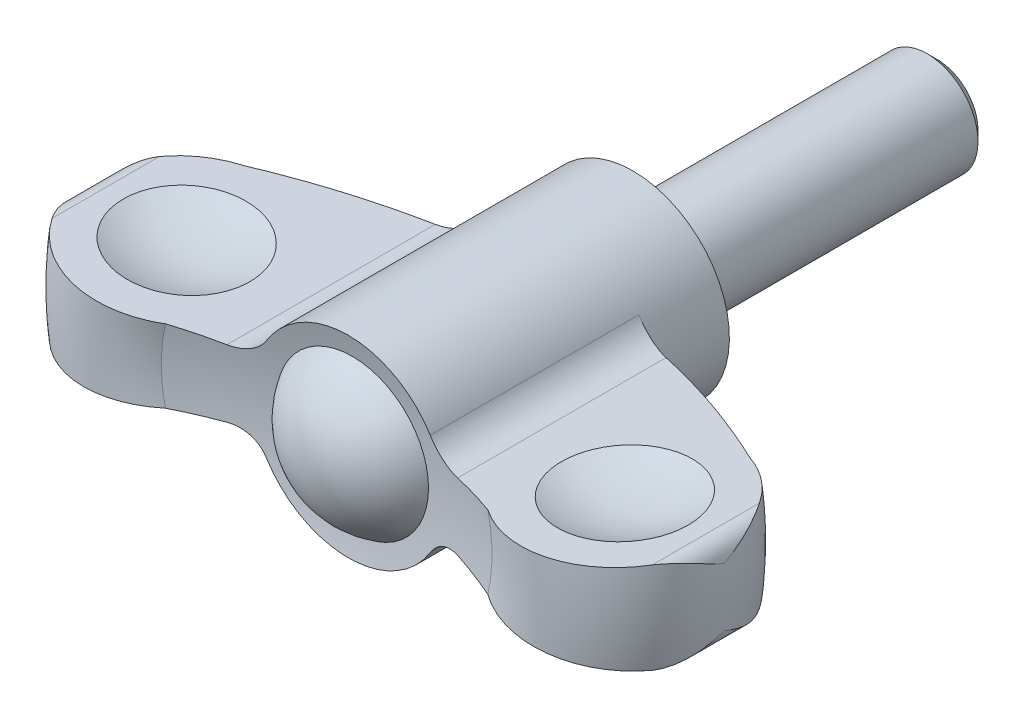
ISO-10303-21;
HEADER;
FILE_DESCRIPTION(('STEP AP214'),'2;1');
FILE_NAME('part.step','',(''),(''),'','','');
FILE_SCHEMA(('AUTOMOTIVE_DESIGN { 1 0 10303 214 1 1 1 1 }'));
ENDSEC;
DATA;
#1=APPLICATION_CONTEXT('core data for automotive mechanical design processes');
#2=APPLICATION_PROTOCOL_DEFINITION('international standard','automotive_design',2000,#1);
#3=PRODUCT_CONTEXT('',#1,'mechanical');
#4=PRODUCT('Part','Part','',(#3));
#5=PRODUCT_RELATED_PRODUCT_CATEGORY('part','',(#4));
#6=PRODUCT_DEFINITION_FORMATION('','',#4);
#7=PRODUCT_DEFINITION_CONTEXT('part definition',#1,'design');
#8=PRODUCT_DEFINITION('design','',#6,#7);
#9=PRODUCT_DEFINITION_SHAPE('','',#8);
#10=(LENGTH_UNIT() NAMED_UNIT(*) SI_UNIT(.MILLI.,.METRE.));
#11=(NAMED_UNIT(*) PLANE_ANGLE_UNIT() SI_UNIT($,.RADIAN.));
#12=(NAMED_UNIT(*) SI_UNIT($,.STERADIAN.) SOLID_ANGLE_UNIT());
#13=UNCERTAINTY_MEASURE_WITH_UNIT(LENGTH_MEASURE(1.E-05),#10,'distance_accuracy_value','');
#14=(GEOMETRIC_REPRESENTATION_CONTEXT(3) GLOBAL_UNCERTAINTY_ASSIGNED_CONTEXT((#13)) GLOBAL_UNIT_ASSIGNED_CONTEXT((#10,
#11,#12)) REPRESENTATION_CONTEXT('',''));
#15=CARTESIAN_POINT('',(0.,0.,0.));
#16=DIRECTION('',(0.,0.,1.));
#17=DIRECTION('',(1.,0.,0.));
#18=AXIS2_PLACEMENT_3D('',#15,#16,#17);
#19=CARTESIAN_POINT('',(0.,0.,76.6132216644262));
#20=DIRECTION('',(0.,0.,1.));
#21=DIRECTION('',(0.,1.,0.));
#22=AXIS2_PLACEMENT_3D('',#19,#20,#21);
#23=DEGENERATE_TOROIDAL_SURFACE('',#22,7.41274216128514,71.1525000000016,.F.);
#24=CARTESIAN_POINT('',(0.,0.,7.5));
#25=DIRECTION('',(0.,0.,1.));
#26=DIRECTION('',(0.,1.,0.));
#27=AXIS2_PLACEMENT_3D('',#24,#25,#26);
#28=CIRCLE('',#27,9.5);
#29=CARTESIAN_POINT('',(8.07537706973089,-5.00382705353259,7.5));
#30=VERTEX_POINT('',#29);
#31=CARTESIAN_POINT('',(8.07537711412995,5.0038269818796,7.5));
#32=VERTEX_POINT('',#31);
#33=EDGE_CURVE('E157',#30,#32,#28,.T.);
#34=ORIENTED_EDGE('',*,*,#33,.T.);
#35=CARTESIAN_POINT('',(8.07525319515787,5.00402698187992,7.50000000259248));
#36=CARTESIAN_POINT('',(8.12665454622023,4.92103773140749,7.49999174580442));
#37=CARTESIAN_POINT('',(8.18144861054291,4.84015820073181,7.50133541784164));
#38=CARTESIAN_POINT('',(8.29736182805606,4.68318005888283,7.50668034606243));
#39=CARTESIAN_POINT('',(8.35847989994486,4.607080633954,7.51068114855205));
#40=CARTESIAN_POINT('',(8.48644181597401,4.46037528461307,7.52128110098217));
#41=CARTESIAN_POINT('',(8.55327127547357,4.38975636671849,7.52787386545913));
#42=CARTESIAN_POINT('',(8.69224302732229,4.25429556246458,7.54356393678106));
#43=CARTESIAN_POINT('',(8.76438537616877,4.18945373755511,7.55266127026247));
#44=CARTESIAN_POINT('',(8.98795756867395,4.00427129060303,7.58354719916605));
#45=CARTESIAN_POINT('',(9.14667405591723,3.89311211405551,7.60894168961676));
#46=CARTESIAN_POINT('',(9.4786404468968,3.69815734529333,7.66816076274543));
#47=CARTESIAN_POINT('',(9.65189888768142,3.61437796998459,7.70199032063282));
#48=CARTESIAN_POINT('',(10.0125625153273,3.47403571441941,7.77763329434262));
#49=CARTESIAN_POINT('',(10.2002114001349,3.41819606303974,7.8196232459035));
#50=CARTESIAN_POINT('',(10.5805892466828,3.33774343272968,7.90948197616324));
#51=CARTESIAN_POINT('',(10.7733131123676,3.31310026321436,7.95734502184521));
#52=CARTESIAN_POINT('',(11.033653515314,3.30081513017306,8.02491673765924));
#53=CARTESIAN_POINT('',(11.1013248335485,3.29954054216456,8.04274730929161));
#54=CARTESIAN_POINT('',(11.236373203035,3.30079631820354,8.07885369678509));
#55=CARTESIAN_POINT('',(11.3037505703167,3.30331932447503,8.09712858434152));
#56=CARTESIAN_POINT('',(11.3709729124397,3.30772213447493,8.11561851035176));
#57=B_SPLINE_CURVE_WITH_KNOTS('',3,(#35,#36,#37,#38,#39,#40,#41,#42,#43,#44,#45,#46,#47,#48,#49,
#50,#51,#52,#53,#54,#55,#56),.UNSPECIFIED.,.F.,.F.,(4,2,2,2,2,2,2,2,2,2,4),(0.,
0.292752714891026,0.585455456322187,0.87744157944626,1.16943080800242,1.75277206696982,
2.33645821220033,2.93455895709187,3.53208044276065,3.74198071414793,3.95147483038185),.UNSPECIFIED.);
#58=CARTESIAN_POINT('',(11.3707729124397,3.30770903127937,8.11556349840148));
#59=VERTEX_POINT('',#58);
#60=EDGE_CURVE('E251',#32,#59,#57,.T.);
#61=ORIENTED_EDGE('',*,*,#60,.T.);
#62=CARTESIAN_POINT('',(24.9191403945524,4.19496480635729,13.4109144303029));
#63=CARTESIAN_POINT('',(23.8381391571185,4.12417217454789,12.8535823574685));
#64=CARTESIAN_POINT('',(22.7428134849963,4.05244146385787,12.324205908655));
#65=CARTESIAN_POINT('',(20.5293345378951,3.90748510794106,11.3241128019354));
#66=CARTESIAN_POINT('',(19.4112500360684,3.83426396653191,10.8532432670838));
#67=CARTESIAN_POINT('',(17.1522467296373,3.68632631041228,9.96991193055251));
#68=CARTESIAN_POINT('',(16.0113274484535,3.61160976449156,9.55745134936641));
#69=CARTESIAN_POINT('',(14.2836536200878,3.49846782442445,8.98318373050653));
#70=CARTESIAN_POINT('',(13.7042390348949,3.46052310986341,8.79894257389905));
#71=CARTESIAN_POINT('',(12.5407906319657,3.38433117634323,8.44572577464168));
#72=CARTESIAN_POINT('',(11.956756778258,3.34608395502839,8.27675025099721));
#73=CARTESIAN_POINT('',(11.3705729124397,3.30769593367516,8.11550848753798));
#74=B_SPLINE_CURVE_WITH_KNOTS('',3,(#62,#63,#64,#65,#66,#67,#68,#69,#70,#71,#72,#73),
.UNSPECIFIED.,.F.,.F.,(4,2,2,2,2,4),(0.,3.65437061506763,7.29898215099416,10.9436698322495,
12.771042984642,14.5984303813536),.UNSPECIFIED.);
#75=CARTESIAN_POINT('',(24.9187524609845,4.19493940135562,13.4107144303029));
#76=VERTEX_POINT('',#75);
#77=EDGE_CURVE('E242',#76,#59,#74,.T.);
#78=ORIENTED_EDGE('',*,*,#77,.F.);
#79=CARTESIAN_POINT('',(0.,0.,13.4107144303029));
#80=DIRECTION('',(0.,0.,1.));
#81=DIRECTION('',(0.,1.,0.));
#82=AXIS2_PLACEMENT_3D('',#79,#80,#81);
#83=CIRCLE('',#82,25.2693834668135);
#84=CARTESIAN_POINT('',(24.9187524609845,-4.19493940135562,13.4107144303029));
#85=VERTEX_POINT('',#84);
#86=EDGE_CURVE('E402',#85,#76,#83,.T.);
#87=ORIENTED_EDGE('',*,*,#86,.F.);
#88=CARTESIAN_POINT('',(11.3705729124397,-3.30769593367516,8.11550848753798));
#89=CARTESIAN_POINT('',(13.3194357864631,-3.43532310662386,8.65165350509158));
#90=CARTESIAN_POINT('',(15.2454387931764,-3.56145323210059,9.27335320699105));
#91=CARTESIAN_POINT('',(19.0285581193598,-3.80920223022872,10.6774595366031));
#92=CARTESIAN_POINT('',(20.8859409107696,-3.93083855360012,11.4591449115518));
#93=CARTESIAN_POINT('',(23.0778618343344,-4.07438311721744,12.4939591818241));
#94=CARTESIAN_POINT('',(23.4481408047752,-4.09863195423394,12.6727423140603));
#95=CARTESIAN_POINT('',(24.1858660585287,-4.14694412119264,13.0369148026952));
#96=CARTESIAN_POINT('',(24.5533094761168,-4.1710072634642,13.2223099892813));
#97=CARTESIAN_POINT('',(24.9191403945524,-4.19496480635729,13.4109144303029));
#98=B_SPLINE_CURVE_WITH_KNOTS('',3,(#88,#89,#90,#91,#92,#93,#94,#95,#96,#97),.UNSPECIFIED.,.F.,
.F.,(4,2,2,2,4),(0.,6.07517314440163,12.1235385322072,13.3591937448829,14.5959668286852),.UNSPECIFIED.);
#99=CARTESIAN_POINT('',(11.3707729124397,-3.30770903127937,8.11556349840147));
#100=VERTEX_POINT('',#99);
#101=EDGE_CURVE('E232',#100,#85,#98,.T.);
#102=ORIENTED_EDGE('',*,*,#101,.F.);
#103=CARTESIAN_POINT('',(11.3709729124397,-3.30772213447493,8.11561851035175));
#104=CARTESIAN_POINT('',(11.2701325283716,-3.30110509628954,8.08788118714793));
#105=CARTESIAN_POINT('',(11.1688817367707,-3.29874082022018,8.06061250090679));
#106=CARTESIAN_POINT('',(10.9662236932,-3.3025707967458,8.00721735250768));
#107=CARTESIAN_POINT('',(10.86481641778,-3.30876648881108,7.98109108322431));
#108=CARTESIAN_POINT('',(10.6624409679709,-3.32978238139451,7.93016922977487));
#109=CARTESIAN_POINT('',(10.5614733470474,-3.34461137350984,7.90537503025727));
#110=CARTESIAN_POINT('',(10.3608328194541,-3.38287019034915,7.85737208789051));
#111=CARTESIAN_POINT('',(10.2611598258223,-3.40629943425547,7.83416323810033));
#112=CARTESIAN_POINT('',(9.96486870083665,-3.48949811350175,7.76717843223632));
#113=CARTESIAN_POINT('',(9.77109378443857,-3.56216663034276,7.72607333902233));
#114=CARTESIAN_POINT('',(9.39755022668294,-3.74054378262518,7.65286990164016));
#115=CARTESIAN_POINT('',(9.21777675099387,-3.84624095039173,7.62076843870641));
#116=CARTESIAN_POINT('',(8.96611052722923,-4.02532517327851,7.58103605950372));
#117=CARTESIAN_POINT('',(8.88646307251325,-4.08719630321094,7.56933067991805));
#118=CARTESIAN_POINT('',(8.73245596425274,-4.21758210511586,7.54853793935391));
#119=CARTESIAN_POINT('',(8.65809406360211,-4.28609392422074,7.53944946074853));
#120=CARTESIAN_POINT('',(8.51538277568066,-4.42916784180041,7.52402786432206));
#121=CARTESIAN_POINT('',(8.44702397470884,-4.50372010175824,7.51769036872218));
#122=CARTESIAN_POINT('',(8.31677244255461,-4.65839173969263,7.50784180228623));
#123=CARTESIAN_POINT('',(8.25487550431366,-4.73850743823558,7.50432888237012));
#124=CARTESIAN_POINT('',(8.1753277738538,-4.85096452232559,7.50150027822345));
#125=CARTESIAN_POINT('',(8.15464683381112,-4.88116885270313,7.50093670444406));
#126=CARTESIAN_POINT('',(8.11423881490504,-4.94215928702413,7.50018643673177));
#127=CARTESIAN_POINT('',(8.09451057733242,-4.97294461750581,7.49999927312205));
#128=CARTESIAN_POINT('',(8.07525315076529,-5.00402705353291,7.50000000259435));
#129=B_SPLINE_CURVE_WITH_KNOTS('',3,(#103,#104,#105,#106,#107,#108,#109,#110,#111,#112,#113,
#114,#115,#116,#117,#118,#119,#120,#121,#122,#123,#124,#125,#126,#127,#128),.UNSPECIFIED.,.F.,
.F.,(4,2,2,2,2,2,2,2,2,2,2,2,4),(0.,0.314298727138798,0.628650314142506,0.943322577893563,
1.25797359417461,1.88762970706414,2.51706744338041,2.82134305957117,3.12548853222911,
3.42914821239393,3.73260894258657,3.8424257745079,3.95210549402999),.UNSPECIFIED.);
#130=EDGE_CURVE('E222',#100,#30,#129,.T.);
#131=ORIENTED_EDGE('',*,*,#130,.T.);
#132=EDGE_LOOP('',(#34,#61,#78,#87,#102,#131));
#133=FACE_BOUND('',#132,.T.);
#134=ADVANCED_FACE('F14',(#133),#23,.F.);
#135=CARTESIAN_POINT('',(0.,0.,22.4));
#136=DIRECTION('',(0.,0.,1.));
#137=DIRECTION('',(0.,1.,0.));
#138=AXIS2_PLACEMENT_3D('',#135,#136,#137);
#139=TOROIDAL_SURFACE('',#138,21.9,9.6);
#140=CARTESIAN_POINT('',(-18.1474454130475,-3.75149990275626,13.4105144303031));
#141=CARTESIAN_POINT('',(-17.8905850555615,-3.73467862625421,13.5060281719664));
#142=CARTESIAN_POINT('',(-17.6377608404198,-3.71812166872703,13.6124268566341));
#143=CARTESIAN_POINT('',(-17.1419285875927,-3.68565059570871,13.8461211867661));
#144=CARTESIAN_POINT('',(-16.8989202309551,-3.66973645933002,13.9734161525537));
#145=CARTESIAN_POINT('',(-16.4245099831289,-3.63866827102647,14.2479997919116));
#146=CARTESIAN_POINT('',(-16.1931050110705,-3.62351401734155,14.3952831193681));
#147=CARTESIAN_POINT('',(-15.743480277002,-3.59406898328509,14.7088327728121));
#148=CARTESIAN_POINT('',(-15.5252603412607,-3.57977819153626,14.8750988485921));
#149=CARTESIAN_POINT('',(-15.1034606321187,-3.55215536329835,15.2255617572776));
#150=CARTESIAN_POINT('',(-14.8998888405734,-3.53882384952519,15.4097682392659));
#151=CARTESIAN_POINT('',(-14.5090032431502,-3.51322552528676,15.794766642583));
#152=CARTESIAN_POINT('',(-14.321689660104,-3.50095872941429,15.9955587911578));
#153=CARTESIAN_POINT('',(-13.9647725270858,-3.4775849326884,16.4122828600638));
#154=CARTESIAN_POINT('',(-13.7951642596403,-3.46647762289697,16.6282107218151));
#155=CARTESIAN_POINT('',(-13.4749045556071,-3.44550444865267,17.073751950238));
#156=CARTESIAN_POINT('',(-13.3242529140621,-3.43563857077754,17.3033651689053));
#157=CARTESIAN_POINT('',(-13.0439598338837,-3.41728273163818,17.7732237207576));
#158=CARTESIAN_POINT('',(-12.9141954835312,-3.40878472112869,18.0133954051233));
#159=CARTESIAN_POINT('',(-12.6756273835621,-3.39316136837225,18.5039680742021));
#160=CARTESIAN_POINT('',(-12.5668227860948,-3.38603597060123,18.7543686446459));
#161=CARTESIAN_POINT('',(-12.3710778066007,-3.37321701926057,19.2636307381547));
#162=CARTESIAN_POINT('',(-12.2841387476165,-3.36752355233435,19.5224927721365));
#163=CARTESIAN_POINT('',(-12.1328924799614,-3.35761873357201,20.0467739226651));
#164=CARTESIAN_POINT('',(-12.0685848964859,-3.35340735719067,20.3121929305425));
#165=CARTESIAN_POINT('',(-11.9641647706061,-3.34656908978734,20.842606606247));
#166=CARTESIAN_POINT('',(-11.9236219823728,-3.34391402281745,21.1075162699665));
#167=CARTESIAN_POINT('',(-11.8652424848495,-3.34009086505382,21.6398358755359));
#168=CARTESIAN_POINT('',(-11.8474054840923,-3.33892275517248,21.9072457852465));
#169=CARTESIAN_POINT('',(-11.8345982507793,-3.33808403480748,22.4425774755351));
#170=CARTESIAN_POINT('',(-11.8396248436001,-3.33841321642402,22.7104991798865));
#171=CARTESIAN_POINT('',(-11.8724923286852,-3.34056564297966,23.2449323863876));
#172=CARTESIAN_POINT('',(-11.9003331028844,-3.34238888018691,23.5114438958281));
#173=CARTESIAN_POINT('',(-11.9780680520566,-3.34747958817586,24.0376567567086));
#174=CARTESIAN_POINT('',(-12.027669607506,-3.35072789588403,24.2974015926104));
#175=CARTESIAN_POINT('',(-12.1484267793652,-3.35863604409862,24.811805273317));
#176=CARTESIAN_POINT('',(-12.2195821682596,-3.36329586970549,25.0664641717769));
#177=CARTESIAN_POINT('',(-12.3828443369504,-3.37398758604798,25.5689078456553));
#178=CARTESIAN_POINT('',(-12.4749485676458,-3.38001930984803,25.8166934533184));
#179=CARTESIAN_POINT('',(-12.679407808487,-3.39340894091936,26.3038316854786));
#180=CARTESIAN_POINT('',(-12.7917703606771,-3.40076734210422,26.543181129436));
#181=CARTESIAN_POINT('',(-13.0369078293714,-3.41682090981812,27.0137884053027));
#182=CARTESIAN_POINT('',(-13.1698514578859,-3.42552712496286,27.2449579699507));
#183=CARTESIAN_POINT('',(-13.4544154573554,-3.44416265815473,27.6954567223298));
#184=CARTESIAN_POINT('',(-13.6060365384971,-3.45409202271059,27.9147854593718));
#185=CARTESIAN_POINT('',(-13.9268367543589,-3.47510059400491,28.3401572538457));
#186=CARTESIAN_POINT('',(-14.0960166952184,-3.48617985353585,28.5461997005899));
#187=CARTESIAN_POINT('',(-14.4507138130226,-3.50940826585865,28.9436423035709));
#188=CARTESIAN_POINT('',(-14.6362312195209,-3.52155743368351,29.1350422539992));
#189=CARTESIAN_POINT('',(-15.0260268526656,-3.54708437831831,29.5054914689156));
#190=CARTESIAN_POINT('',(-15.2305978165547,-3.56048132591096,29.6842314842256));
#191=CARTESIAN_POINT('',(-15.6538967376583,-3.58820233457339,30.0239900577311));
#192=CARTESIAN_POINT('',(-15.8726245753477,-3.6025263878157,30.1850087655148));
#193=CARTESIAN_POINT('',(-16.322752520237,-3.63200437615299,30.4882695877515));
#194=CARTESIAN_POINT('',(-16.5541555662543,-3.6471585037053,30.6305073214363));
#195=CARTESIAN_POINT('',(-17.0278914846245,-3.67818253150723,30.8951425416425));
#196=CARTESIAN_POINT('',(-17.2702206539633,-3.69405218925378,31.017546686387));
#197=CARTESIAN_POINT('',(-17.7669669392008,-3.72658312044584,31.2429802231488));
#198=CARTESIAN_POINT('',(-18.0214889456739,-3.74325126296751,31.3457775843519));
#199=CARTESIAN_POINT('',(-18.538265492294,-3.77709393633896,31.5295393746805));
#200=CARTESIAN_POINT('',(-18.8005200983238,-3.79426847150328,31.6105036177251));
#201=CARTESIAN_POINT('',(-19.3309113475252,-3.82900274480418,31.7500060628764));
#202=CARTESIAN_POINT('',(-19.5990481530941,-3.84656249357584,31.8085436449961));
#203=CARTESIAN_POINT('',(-20.1392890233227,-3.88194179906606,31.9027453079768));
#204=CARTESIAN_POINT('',(-20.4113930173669,-3.89976135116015,31.9384097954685));
#205=CARTESIAN_POINT('',(-20.9576381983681,-3.93553386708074,31.9865808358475));
#206=CARTESIAN_POINT('',(-21.2317794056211,-3.95348683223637,31.9990871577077));
#207=CARTESIAN_POINT('',(-21.7801364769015,-3.98939765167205,32.0008164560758));
#208=CARTESIAN_POINT('',(-22.0543523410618,-4.00735550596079,31.9900393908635));
#209=CARTESIAN_POINT('',(-22.6008596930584,-4.04314519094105,31.9452447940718));
#210=CARTESIAN_POINT('',(-22.8731513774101,-4.06097703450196,31.9112296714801));
#211=CARTESIAN_POINT('',(-23.4138724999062,-4.09638779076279,31.8201695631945));
#212=CARTESIAN_POINT('',(-23.6823019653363,-4.1139667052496,31.7631247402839));
#213=CARTESIAN_POINT('',(-24.2118784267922,-4.14864761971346,31.6267614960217));
#214=CARTESIAN_POINT('',(-24.4730575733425,-4.16575172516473,31.547568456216));
#215=CARTESIAN_POINT('',(-24.987795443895,-4.19946088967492,31.3673123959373));
#216=CARTESIAN_POINT('',(-25.2413540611,-4.2160659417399,31.2662490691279));
#217=CARTESIAN_POINT('',(-25.7391278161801,-4.24866415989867,31.0428965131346));
#218=CARTESIAN_POINT('',(-25.9833385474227,-4.26465703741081,30.9205974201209));
#219=CARTESIAN_POINT('',(-26.4605066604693,-4.29590583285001,30.655664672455));
#220=CARTESIAN_POINT('',(-26.6934645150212,-4.31116178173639,30.5130318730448));
#221=CARTESIAN_POINT('',(-27.1452633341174,-4.34074919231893,30.2092249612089));
#222=CARTESIAN_POINT('',(-27.3641711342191,-4.35508503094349,30.0481506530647));
#223=CARTESIAN_POINT('',(-27.7875859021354,-4.38281362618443,29.7080080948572));
#224=CARTESIAN_POINT('',(-27.9920934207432,-4.39620641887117,29.5289405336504));
#225=CARTESIAN_POINT('',(-28.3848624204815,-4.42192808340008,29.1544313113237));
#226=CARTESIAN_POINT('',(-28.5731528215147,-4.43425884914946,28.9590200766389));
#227=CARTESIAN_POINT('',(-28.9324617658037,-4.45778928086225,28.5530043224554));
#228=CARTESIAN_POINT('',(-29.1034908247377,-4.4689896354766,28.3424091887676));
#229=CARTESIAN_POINT('',(-29.319374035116,-4.48312739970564,28.0522910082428));
#230=CARTESIAN_POINT('',(-29.3724491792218,-4.48660318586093,27.9788119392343));
#231=CARTESIAN_POINT('',(-29.4764415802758,-4.49341344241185,27.8304567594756));
#232=CARTESIAN_POINT('',(-29.5273611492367,-4.49674806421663,27.7555822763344));
#233=CARTESIAN_POINT('',(-29.5772181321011,-4.50001309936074,27.679991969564));
#234=B_SPLINE_CURVE_WITH_KNOTS('',3,(#140,#141,#142,#143,#144,#145,#146,#147,#148,#149,#150,
#151,#152,#153,#154,#155,#156,#157,#158,#159,#160,#161,#162,#163,#164,#165,#166,#167,#168,#169,
#170,#171,#172,#173,#174,#175,#176,#177,#178,#179,#180,#181,#182,#183,#184,#185,#186,#187,#188,
#189,#190,#191,#192,#193,#194,#195,#196,#197,#198,#199,#200,#201,#202,#203,#204,#205,#206,#207,
#208,#209,#210,#211,#212,#213,#214,#215,#216,#217,#218,#219,#220,#221,#222,#223,#224,#225,#226,
#227,#228,#229,#230,#231,#232,#233),.UNSPECIFIED.,.F.,.F.,(4,2,2,2,2,2,2,2,2,2,2,2,2,2,2,2,2,2,
2,2,2,2,2,2,2,2,2,2,2,2,2,2,2,2,2,2,2,2,2,2,2,2,2,2,2,2,4),(0.,0.82342903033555,
1.64683128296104,2.47001373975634,3.29318534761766,4.11680216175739,4.9404302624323,
5.76383834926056,6.58723753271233,7.40559872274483,8.22392680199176,9.04230438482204,
9.86066841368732,10.6637182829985,11.4667578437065,12.2696859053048,13.0726098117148,
13.8650526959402,14.6574872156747,15.449825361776,16.2424591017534,17.0419728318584,
17.8415169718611,18.6410978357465,19.4406899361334,20.2556974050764,21.0706979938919,
21.8858883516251,22.7008044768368,23.5248358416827,24.3488742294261,25.1729353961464,
25.9969819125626,26.8210366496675,27.6450928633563,28.469063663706,29.2930286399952,
30.1124203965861,30.9318236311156,31.7516084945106,32.5713588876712,33.3868657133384,
34.2023413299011,35.0163312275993,35.8298222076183,36.1019244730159,36.3737270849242),.UNSPECIFIED.);
#235=CARTESIAN_POINT('',(-15.8916566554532,-3.60377276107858,30.1939503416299));
#236=VERTEX_POINT('',#235);
#237=CARTESIAN_POINT('',(-29.5770181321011,-4.5,27.6802951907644));
#238=VERTEX_POINT('',#237);
#239=EDGE_CURVE('E276',#236,#238,#234,.T.);
#240=ORIENTED_EDGE('',*,*,#239,.F.);
#241=CARTESIAN_POINT('',(0.,0.,30.1939503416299));
#242=DIRECTION('',(0.,0.,1.));
#243=DIRECTION('',(0.,1.,0.));
#244=AXIS2_PLACEMENT_3D('',#241,#242,#243);
#245=CIRCLE('',#244,16.2951504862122);
#246=CARTESIAN_POINT('',(-15.8916566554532,3.60377276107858,30.1939503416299));
#247=VERTEX_POINT('',#246);
#248=EDGE_CURVE('E210',#247,#236,#245,.T.);
#249=ORIENTED_EDGE('',*,*,#248,.F.);
#250=CARTESIAN_POINT('',(-29.577218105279,4.50001309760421,27.6799920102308));
#251=CARTESIAN_POINT('',(-29.4283813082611,4.49026607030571,27.9057071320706));
#252=CARTESIAN_POINT('',(-29.2699701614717,4.47989203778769,28.1250732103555));
#253=CARTESIAN_POINT('',(-28.9352574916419,4.45797236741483,28.5496181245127));
#254=CARTESIAN_POINT('',(-28.7589571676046,4.44642680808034,28.7547979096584));
#255=CARTESIAN_POINT('',(-28.3898682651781,4.42225590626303,29.1493363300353));
#256=CARTESIAN_POINT('',(-28.1970944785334,4.40963153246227,29.3387088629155));
#257=CARTESIAN_POINT('',(-27.7963194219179,4.38338556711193,29.7005094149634));
#258=CARTESIAN_POINT('',(-27.5883182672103,4.3697639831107,29.872937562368));
#259=CARTESIAN_POINT('',(-27.1584989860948,4.34161596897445,30.199703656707));
#260=CARTESIAN_POINT('',(-26.9366758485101,4.32708921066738,30.3540349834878));
#261=CARTESIAN_POINT('',(-26.4808650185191,4.29723906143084,30.6434656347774));
#262=CARTESIAN_POINT('',(-26.2468771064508,4.28191565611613,30.7785646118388));
#263=CARTESIAN_POINT('',(-25.7684462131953,4.25058416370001,31.0285776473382));
#264=CARTESIAN_POINT('',(-25.5240048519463,4.23457618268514,31.1434948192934));
#265=CARTESIAN_POINT('',(-25.0263706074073,4.20198710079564,31.3523874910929));
#266=CARTESIAN_POINT('',(-24.773177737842,4.1854060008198,31.4463630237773));
#267=CARTESIAN_POINT('',(-24.2590478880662,4.15173665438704,31.6129966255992));
#268=CARTESIAN_POINT('',(-23.9980896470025,4.13464701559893,31.685588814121));
#269=CARTESIAN_POINT('',(-23.4709078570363,4.10012292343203,31.8086173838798));
#270=CARTESIAN_POINT('',(-23.2046821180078,4.08268832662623,31.8590443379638));
#271=CARTESIAN_POINT('',(-22.6689091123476,4.04760161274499,31.9373839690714));
#272=CARTESIAN_POINT('',(-22.3993613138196,4.0299494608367,31.9652929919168));
#273=CARTESIAN_POINT('',(-21.8589964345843,3.99456203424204,31.9984159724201));
#274=CARTESIAN_POINT('',(-21.5881799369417,3.97682679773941,32.0036394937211));
#275=CARTESIAN_POINT('',(-21.0454404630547,3.94128386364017,31.9913795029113));
#276=CARTESIAN_POINT('',(-20.7735205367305,3.9234763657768,31.9737602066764));
#277=CARTESIAN_POINT('',(-20.2321124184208,3.88802061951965,31.9157373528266));
#278=CARTESIAN_POINT('',(-19.9626242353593,3.8703723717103,31.8753337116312));
#279=CARTESIAN_POINT('',(-19.4280257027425,3.83536257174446,31.7720671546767));
#280=CARTESIAN_POINT('',(-19.1629144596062,3.81800096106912,31.7092088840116));
#281=CARTESIAN_POINT('',(-18.6387730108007,3.78367597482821,31.5614710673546));
#282=CARTESIAN_POINT('',(-18.3797450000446,3.76671274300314,31.4765837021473));
#283=CARTESIAN_POINT('',(-17.8682212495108,3.73321406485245,31.2848646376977));
#284=CARTESIAN_POINT('',(-17.6157711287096,3.71668160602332,31.177910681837));
#285=CARTESIAN_POINT('',(-17.1207307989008,3.6842623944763,30.9431230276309));
#286=CARTESIAN_POINT('',(-16.8781406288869,3.66837564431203,30.8152892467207));
#287=CARTESIAN_POINT('',(-16.4045275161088,3.63735965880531,30.5396362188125));
#288=CARTESIAN_POINT('',(-16.1735051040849,3.62223045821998,30.3918160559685));
#289=CARTESIAN_POINT('',(-15.7246794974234,3.59283775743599,30.0772205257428));
#290=CARTESIAN_POINT('',(-15.5068766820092,3.57857428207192,29.9104446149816));
#291=CARTESIAN_POINT('',(-15.0856203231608,3.55098703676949,29.5587225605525));
#292=CARTESIAN_POINT('',(-14.8821981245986,3.53766531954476,29.3737387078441));
#293=CARTESIAN_POINT('',(-14.4917116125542,3.51209313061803,28.9871837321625));
#294=CARTESIAN_POINT('',(-14.3046468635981,3.49984263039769,28.7856130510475));
#295=CARTESIAN_POINT('',(-13.9482722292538,3.47650436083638,28.3672761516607));
#296=CARTESIAN_POINT('',(-13.7789624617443,3.46541659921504,28.1505098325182));
#297=CARTESIAN_POINT('',(-13.4594078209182,3.4444895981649,27.7032976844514));
#298=CARTESIAN_POINT('',(-13.3091625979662,3.43465033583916,27.4728521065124));
#299=CARTESIAN_POINT('',(-13.0300075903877,3.4163690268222,27.0017206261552));
#300=CARTESIAN_POINT('',(-12.9009427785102,3.40791682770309,26.7611269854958));
#301=CARTESIAN_POINT('',(-12.6638563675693,3.39239050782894,26.269856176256));
#302=CARTESIAN_POINT('',(-12.5558264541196,3.38531584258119,26.0191830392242));
#303=CARTESIAN_POINT('',(-12.3616487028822,3.37259952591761,25.5094385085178));
#304=CARTESIAN_POINT('',(-12.2755026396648,3.36695799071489,25.2503664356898));
#305=CARTESIAN_POINT('',(-12.125856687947,3.35715797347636,24.7257346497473));
#306=CARTESIAN_POINT('',(-12.0623564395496,3.35299946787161,24.4601750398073));
#307=CARTESIAN_POINT('',(-11.9595441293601,3.34626649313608,23.9295575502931));
#308=CARTESIAN_POINT('',(-11.9198013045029,3.34366381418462,23.6645834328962));
#309=CARTESIAN_POINT('',(-11.8630211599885,3.33994539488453,23.1322038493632));
#310=CARTESIAN_POINT('',(-11.8459835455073,3.33882963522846,22.8647984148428));
#311=CARTESIAN_POINT('',(-11.8347668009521,3.33809507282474,22.3295252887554));
#312=CARTESIAN_POINT('',(-11.8405860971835,3.33847616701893,22.0616576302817));
#313=CARTESIAN_POINT('',(-11.8750272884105,3.34073165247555,21.5273997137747));
#314=CARTESIAN_POINT('',(-11.9036490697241,3.34260603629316,21.2610094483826));
#315=CARTESIAN_POINT('',(-11.9829240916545,3.34779760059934,20.7350583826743));
#316=CARTESIAN_POINT('',(-12.033288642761,3.35109587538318,20.4754538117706));
#317=CARTESIAN_POINT('',(-12.1555550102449,3.35910285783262,19.961393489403));
#318=CARTESIAN_POINT('',(-12.2274566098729,3.36381155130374,19.7069376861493));
#319=CARTESIAN_POINT('',(-12.3921774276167,3.37459879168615,19.2049950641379));
#320=CARTESIAN_POINT('',(-12.4849912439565,3.38067698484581,18.9575064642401));
#321=CARTESIAN_POINT('',(-12.6908448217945,3.39415792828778,18.470999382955));
#322=CARTESIAN_POINT('',(-12.8038936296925,3.40156127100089,18.2319847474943));
#323=CARTESIAN_POINT('',(-13.050399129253,3.41770442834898,17.7620583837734));
#324=CARTESIAN_POINT('',(-13.1840279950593,3.42645551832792,17.5312373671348));
#325=CARTESIAN_POINT('',(-13.4698675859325,3.4451745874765,17.0815911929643));
#326=CARTESIAN_POINT('',(-13.6220707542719,3.45514207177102,16.8627612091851));
#327=CARTESIAN_POINT('',(-13.9440945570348,3.4762307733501,16.4382825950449));
#328=CARTESIAN_POINT('',(-14.113927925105,3.48735282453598,16.2326436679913));
#329=CARTESIAN_POINT('',(-14.4698944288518,3.51066436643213,15.836072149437));
#330=CARTESIAN_POINT('',(-14.6560271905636,3.52285383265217,15.6451392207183));
#331=CARTESIAN_POINT('',(-15.0471805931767,3.54846969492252,15.2755429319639));
#332=CARTESIAN_POINT('',(-15.2525053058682,3.56191600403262,15.097202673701));
#333=CARTESIAN_POINT('',(-15.6772923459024,3.58973446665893,14.7583242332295));
#334=CARTESIAN_POINT('',(-15.8967545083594,3.60410660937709,14.5977858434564));
#335=CARTESIAN_POINT('',(-16.3478939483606,3.63365083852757,14.2958496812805));
#336=CARTESIAN_POINT('',(-16.5795509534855,3.64882159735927,14.1544214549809));
#337=CARTESIAN_POINT('',(-17.0537037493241,3.67987292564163,13.8914238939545));
#338=CARTESIAN_POINT('',(-17.2961933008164,3.69575308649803,13.769843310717));
#339=CARTESIAN_POINT('',(-17.6425873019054,3.71843774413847,13.6138611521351));
#340=CARTESIAN_POINT('',(-17.7426773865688,3.7249924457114,13.5707938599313));
#341=CARTESIAN_POINT('',(-17.9441132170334,3.7381840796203,13.4880908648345));
#342=CARTESIAN_POINT('',(-18.045457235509,3.74482089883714,13.4484509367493));
#343=CARTESIAN_POINT('',(-18.1474454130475,3.75149990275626,13.4105144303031));
#344=B_SPLINE_CURVE_WITH_KNOTS('',3,(#250,#251,#252,#253,#254,#255,#256,#257,#258,#259,#260,
#261,#262,#263,#264,#265,#266,#267,#268,#269,#270,#271,#272,#273,#274,#275,#276,#277,#278,#279,
#280,#281,#282,#283,#284,#285,#286,#287,#288,#289,#290,#291,#292,#293,#294,#295,#296,#297,#298,
#299,#300,#301,#302,#303,#304,#305,#306,#307,#308,#309,#310,#311,#312,#313,#314,#315,#316,#317,
#318,#319,#320,#321,#322,#323,#324,#325,#326,#327,#328,#329,#330,#331,#332,#333,#334,#335,#336,
#337,#338,#339,#340,#341,#342,#343),.UNSPECIFIED.,.F.,.F.,(4,2,2,2,2,2,2,2,2,2,2,2,2,2,2,2,2,2,
2,2,2,2,2,2,2,2,2,2,2,2,2,2,2,2,2,2,2,2,2,2,2,2,2,2,2,2,4),(0.,0.811383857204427,
1.62271336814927,2.43332187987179,3.24392425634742,4.05482224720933,4.86573488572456,
5.67652231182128,6.48730846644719,7.30056707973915,8.11417124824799,8.92790742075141,
9.7413005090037,10.5595508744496,11.3778042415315,12.1958884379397,13.0142634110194,
13.8373004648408,14.6603407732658,15.4834188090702,16.3065204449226,17.1313641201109,
17.9561858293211,18.7810130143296,19.6058250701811,20.4243011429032,21.2424530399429,
22.0606712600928,22.8788764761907,23.6817568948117,24.4846268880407,25.2874416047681,
26.0902523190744,26.8827166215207,27.6751729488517,28.4674248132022,29.2600317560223,
30.0596712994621,30.8589865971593,31.658883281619,32.4587616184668,33.2746912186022,
34.090611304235,34.9052154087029,35.7193562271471,36.0467859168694,36.3738060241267),.UNSPECIFIED.);
#345=CARTESIAN_POINT('',(-29.577018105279,4.5,27.6802952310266));
#346=VERTEX_POINT('',#345);
#347=EDGE_CURVE('E298',#346,#247,#344,.T.);
#348=ORIENTED_EDGE('',*,*,#347,.F.);
#349=CARTESIAN_POINT('',(-31.369564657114,2.86363636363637,22.4));
#350=CARTESIAN_POINT('',(-31.3693228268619,2.86628559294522,22.4059654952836));
#351=CARTESIAN_POINT('',(-31.3690751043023,2.86893438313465,22.4119311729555));
#352=CARTESIAN_POINT('',(-31.3455550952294,3.11453943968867,22.9652019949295));
#353=CARTESIAN_POINT('',(-31.2727100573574,3.35362322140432,23.5139845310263));
#354=CARTESIAN_POINT('',(-31.0906514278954,3.68216340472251,24.3317563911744));
#355=CARTESIAN_POINT('',(-31.0177760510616,3.78670945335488,24.6035877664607));
#356=CARTESIAN_POINT('',(-30.8477677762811,3.98135441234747,25.1449637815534));
#357=CARTESIAN_POINT('',(-30.7506472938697,4.07146067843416,25.4145095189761));
#358=CARTESIAN_POINT('',(-30.5719332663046,4.20252900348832,25.8529322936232));
#359=CARTESIAN_POINT('',(-30.4974342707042,4.24947683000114,26.0229493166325));
#360=CARTESIAN_POINT('',(-30.3388744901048,4.33328283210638,26.3608778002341));
#361=CARTESIAN_POINT('',(-30.2548212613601,4.37014890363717,26.5287908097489));
#362=CARTESIAN_POINT('',(-30.0769796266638,4.43174329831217,26.8627513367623));
#363=CARTESIAN_POINT('',(-29.9831491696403,4.45641633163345,27.0287870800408));
#364=CARTESIAN_POINT('',(-29.8357178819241,4.48201227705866,27.2752518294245));
#365=CARTESIAN_POINT('',(-29.7853951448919,4.48864307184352,27.3570723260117));
#366=CARTESIAN_POINT('',(-29.6826484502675,4.4976362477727,27.5196657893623));
#367=CARTESIAN_POINT('',(-29.630223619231,4.49999683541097,27.6004383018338));
#368=CARTESIAN_POINT('',(-29.5768181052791,4.4999999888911,27.6805954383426));
#369=B_SPLINE_CURVE_WITH_KNOTS('',3,(#349,#350,#351,#352,#353,#354,#355,#356,#357,#358,#359,
#360,#361,#362,#363,#364,#365,#366,#367,#368),.UNSPECIFIED.,.F.,.F.,(4,2,2,2,2,2,2,2,2,4),(0.,
0.0195959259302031,1.81731826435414,2.71712331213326,3.61646852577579,4.19044381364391,
4.76396827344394,5.34007007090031,5.62881792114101,5.91768701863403),.UNSPECIFIED.);
#370=CARTESIAN_POINT('',(-31.369564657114,2.86363636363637,22.4));
#371=VERTEX_POINT('',#370);
#372=EDGE_CURVE('E360',#371,#346,#369,.T.);
#373=ORIENTED_EDGE('',*,*,#372,.F.);
#374=CARTESIAN_POINT('',(-29.576818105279,4.49999998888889,17.1194045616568));
#375=CARTESIAN_POINT('',(-29.619139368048,4.50000102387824,17.1829266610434));
#376=CARTESIAN_POINT('',(-29.6608485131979,4.49851722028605,17.2468391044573));
#377=CARTESIAN_POINT('',(-29.7429683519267,4.49280699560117,17.3753522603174));
#378=CARTESIAN_POINT('',(-29.7833793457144,4.48858121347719,17.4399528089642));
#379=CARTESIAN_POINT('',(-29.9024609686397,4.47214705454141,17.6344933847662));
#380=CARTESIAN_POINT('',(-29.9791105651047,4.45618046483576,17.765367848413));
#381=CARTESIAN_POINT('',(-30.1263186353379,4.41582925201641,18.0284830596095));
#382=CARTESIAN_POINT('',(-30.1969002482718,4.39147855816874,18.1607162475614));
#383=CARTESIAN_POINT('',(-30.3321494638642,4.33558288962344,18.4267422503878));
#384=CARTESIAN_POINT('',(-30.3968138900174,4.30403408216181,18.5605358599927));
#385=CARTESIAN_POINT('',(-30.5626786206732,4.21088535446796,18.9222641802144));
#386=CARTESIAN_POINT('',(-30.6582400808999,4.1435864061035,19.1513508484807));
#387=CARTESIAN_POINT('',(-30.8316829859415,3.99568952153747,19.6118454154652));
#388=CARTESIAN_POINT('',(-30.9095558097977,3.91508513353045,19.8432543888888));
#389=CARTESIAN_POINT('',(-31.1166837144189,3.65806718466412,20.540705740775));
#390=CARTESIAN_POINT('',(-31.219251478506,3.46657224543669,21.009542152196));
#391=CARTESIAN_POINT('',(-31.3069727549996,3.20184757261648,21.6292554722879));
#392=CARTESIAN_POINT('',(-31.3245600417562,3.13661935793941,21.7798368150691));
#393=CARTESIAN_POINT('',(-31.3522803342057,3.00489991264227,22.080989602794));
#394=CARTESIAN_POINT('',(-31.3624220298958,2.93841024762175,22.2315608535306));
#395=CARTESIAN_POINT('',(-31.3690750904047,2.86893445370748,22.3880686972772));
#396=CARTESIAN_POINT('',(-31.3693228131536,2.86628566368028,22.3940343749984));
#397=CARTESIAN_POINT('',(-31.369564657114,2.86363636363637,22.4));
#398=B_SPLINE_CURVE_WITH_KNOTS('',3,(#374,#375,#376,#377,#378,#379,#380,#381,#382,#383,#384,
#385,#386,#387,#388,#389,#390,#391,#392,#393,#394,#395,#396,#397),.UNSPECIFIED.,.F.,.F.,(4,2,2,
2,2,2,2,2,2,2,2,4),(0.,0.228945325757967,0.457837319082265,0.914918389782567,1.37017104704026,
1.82566667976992,2.59598824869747,3.36668444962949,4.90952775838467,5.40460012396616,
5.89909375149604,5.91868967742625),.UNSPECIFIED.);
#399=CARTESIAN_POINT('',(-29.577018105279,4.5,17.1197047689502));
#400=VERTEX_POINT('',#399);
#401=EDGE_CURVE('E354',#400,#371,#398,.T.);
#402=ORIENTED_EDGE('',*,*,#401,.F.);
#403=CARTESIAN_POINT('',(-24.918217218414,4.19490434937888,13.4105144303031));
#404=CARTESIAN_POINT('',(-25.1747287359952,4.2117027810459,13.5063205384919));
#405=CARTESIAN_POINT('',(-25.4271515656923,4.22823345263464,13.6131252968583));
#406=CARTESIAN_POINT('',(-25.9220334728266,4.26064228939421,13.847863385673));
#407=CARTESIAN_POINT('',(-26.1644920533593,4.27652042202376,13.9757977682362));
#408=CARTESIAN_POINT('',(-26.6315223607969,4.30710531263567,14.2483504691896));
#409=CARTESIAN_POINT('',(-26.8563943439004,4.32183173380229,14.3924524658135));
#410=CARTESIAN_POINT('',(-27.2933789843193,4.35044899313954,14.6988790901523));
#411=CARTESIAN_POINT('',(-27.5054935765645,4.3643399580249,14.8612009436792));
#412=CARTESIAN_POINT('',(-27.888316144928,4.38941025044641,15.180307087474));
#413=CARTESIAN_POINT('',(-28.0607863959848,4.40070498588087,15.3349749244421));
#414=CARTESIAN_POINT('',(-28.3941147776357,4.4225340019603,15.6563910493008));
#415=CARTESIAN_POINT('',(-28.5549737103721,4.43306833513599,15.8231385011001));
#416=CARTESIAN_POINT('',(-28.8677866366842,4.45355383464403,16.1718241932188));
#417=CARTESIAN_POINT('',(-29.0194509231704,4.46348602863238,16.354023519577));
#418=CARTESIAN_POINT('',(-29.3089338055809,4.48244368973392,16.72919338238));
#419=CARTESIAN_POINT('',(-29.4467504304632,4.49146902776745,16.9221654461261));
#420=CARTESIAN_POINT('',(-29.577218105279,4.50001309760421,17.1200079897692));
#421=B_SPLINE_CURVE_WITH_KNOTS('',3,(#403,#404,#405,#406,#407,#408,#409,#410,#411,#412,#413,
#414,#415,#416,#417,#418,#419,#420),.UNSPECIFIED.,.F.,.F.,(4,2,2,2,2,2,2,2,4),(0.,
0.822759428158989,1.64555983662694,2.44710662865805,3.24853154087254,3.94375872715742,
4.63893783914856,5.35009750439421,6.06135825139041),.UNSPECIFIED.);
#422=CARTESIAN_POINT('',(-24.9187524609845,4.19493940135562,13.4107144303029));
#423=VERTEX_POINT('',#422);
#424=EDGE_CURVE('E277',#423,#400,#421,.T.);
#425=ORIENTED_EDGE('',*,*,#424,.F.);
#426=CARTESIAN_POINT('',(-24.9187524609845,-4.19493940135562,13.4107144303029));
#427=VERTEX_POINT('',#426);
#428=EDGE_CURVE('E399',#423,#427,#83,.T.);
#429=ORIENTED_EDGE('',*,*,#428,.T.);
#430=CARTESIAN_POINT('',(-29.5772181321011,-4.50001309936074,17.120008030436));
#431=CARTESIAN_POINT('',(-29.4265102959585,-4.49014354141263,16.8914517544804));
#432=CARTESIAN_POINT('',(-29.2659808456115,-4.4796307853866,16.6694035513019));
#433=CARTESIAN_POINT('',(-28.926581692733,-4.45740420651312,16.2398574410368));
#434=CARTESIAN_POINT('',(-28.7477118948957,-4.44569037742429,16.0323596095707));
#435=CARTESIAN_POINT('',(-28.3777669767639,-4.42146341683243,15.6385922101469));
#436=CARTESIAN_POINT('',(-28.1871253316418,-4.40897867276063,15.45191331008));
#437=CARTESIAN_POINT('',(-27.7910307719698,-4.38303922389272,15.0951091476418));
#438=CARTESIAN_POINT('',(-27.5855799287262,-4.36958465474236,14.9249815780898));
#439=CARTESIAN_POINT('',(-27.188874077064,-4.34360517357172,14.6233879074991));
#440=CARTESIAN_POINT('',(-26.9992422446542,-4.33118656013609,14.4897704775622));
#441=CARTESIAN_POINT('',(-26.6108443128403,-4.30575114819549,14.2366062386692));
#442=CARTESIAN_POINT('',(-26.4120783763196,-4.29273436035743,14.1170591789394));
#443=CARTESIAN_POINT('',(-26.0017910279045,-4.26586545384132,13.890069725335));
#444=CARTESIAN_POINT('',(-25.7900813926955,-4.25200100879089,13.7829689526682));
#445=CARTESIAN_POINT('',(-25.3593416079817,-4.22379271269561,13.5846713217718));
#446=CARTESIAN_POINT('',(-25.1403106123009,-4.20944880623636,13.4934763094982));
#447=CARTESIAN_POINT('',(-24.918217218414,-4.19490434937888,13.4105144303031));
#448=B_SPLINE_CURVE_WITH_KNOTS('',3,(#430,#431,#432,#433,#434,#435,#436,#437,#438,#439,#440,
#441,#442,#443,#444,#445,#446,#447),.UNSPECIFIED.,.F.,.F.,(4,2,2,2,2,2,2,2,4),(0.,
0.821594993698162,1.64319425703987,2.44361485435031,3.24392371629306,3.94026356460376,
4.63659100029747,5.34893291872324,6.06135745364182),.UNSPECIFIED.);
#449=CARTESIAN_POINT('',(-29.5770181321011,-4.5,17.1197048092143));
#450=VERTEX_POINT('',#449);
#451=EDGE_CURVE('E530',#450,#427,#448,.T.);
#452=ORIENTED_EDGE('',*,*,#451,.F.);
#453=CARTESIAN_POINT('',(-31.369564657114,-2.86363636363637,22.4));
#454=CARTESIAN_POINT('',(-31.3693228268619,-2.86628559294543,22.3940345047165));
#455=CARTESIAN_POINT('',(-31.3690751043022,-2.86893438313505,22.3880688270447));
#456=CARTESIAN_POINT('',(-31.3455550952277,-3.11453943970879,21.8347980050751));
#457=CARTESIAN_POINT('',(-31.272710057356,-3.35362322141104,21.2860154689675));
#458=CARTESIAN_POINT('',(-31.0906514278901,-3.68216340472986,20.468243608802));
#459=CARTESIAN_POINT('',(-31.0177760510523,-3.78670945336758,20.1964122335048));
#460=CARTESIAN_POINT('',(-30.8477677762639,-3.98135441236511,19.6550362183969));
#461=CARTESIAN_POINT('',(-30.7506472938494,-4.07146067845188,19.3854904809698));
#462=CARTESIAN_POINT('',(-30.5719332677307,-4.20252900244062,18.947067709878));
#463=CARTESIAN_POINT('',(-30.4974342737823,-4.2494768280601,18.7770506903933));
#464=CARTESIAN_POINT('',(-30.3388744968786,-4.33328282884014,18.4391222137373));
#465=CARTESIAN_POINT('',(-30.2548212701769,-4.37014889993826,18.2712092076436));
#466=CARTESIAN_POINT('',(-30.0769796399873,-4.43174329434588,17.9372486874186));
#467=CARTESIAN_POINT('',(-29.9831491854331,-4.45641632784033,17.7712129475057));
#468=CARTESIAN_POINT('',(-29.8357179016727,-4.48201227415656,17.5247482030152));
#469=CARTESIAN_POINT('',(-29.7853951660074,-4.48864306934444,17.4429277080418));
#470=CARTESIAN_POINT('',(-29.6826484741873,-4.49763624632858,17.2803342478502));
#471=CARTESIAN_POINT('',(-29.6302236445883,-4.49999683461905,17.1995617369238));
#472=CARTESIAN_POINT('',(-29.5768181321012,-4.49999998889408,17.119404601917));
#473=B_SPLINE_CURVE_WITH_KNOTS('',3,(#453,#454,#455,#456,#457,#458,#459,#460,#461,#462,#463,
#464,#465,#466,#467,#468,#469,#470,#471,#472),.UNSPECIFIED.,.F.,.F.,(4,2,2,2,2,2,2,2,2,4),(0.,
0.0195959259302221,1.81731826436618,2.71712331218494,3.61646852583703,4.19044380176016,
4.76396824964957,5.34007003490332,5.62881787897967,5.91768697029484),.UNSPECIFIED.);
#474=CARTESIAN_POINT('',(-31.369564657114,-2.86363636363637,22.4));
#475=VERTEX_POINT('',#474);
#476=EDGE_CURVE('E372',#475,#450,#473,.T.);
#477=ORIENTED_EDGE('',*,*,#476,.F.);
#478=CARTESIAN_POINT('',(-29.576818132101,-4.49999998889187,27.6805953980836));
#479=CARTESIAN_POINT('',(-29.6191393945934,-4.50000102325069,27.6170732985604));
#480=CARTESIAN_POINT('',(-29.6608485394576,-4.49851721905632,27.5531608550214));
#481=CARTESIAN_POINT('',(-29.7429683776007,-4.49280699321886,27.4246476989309));
#482=CARTESIAN_POINT('',(-29.7833793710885,-4.48858121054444,27.3600471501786));
#483=CARTESIAN_POINT('',(-29.9024609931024,-4.47214705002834,27.1655065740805));
#484=CARTESIAN_POINT('',(-29.9791105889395,-4.45618045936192,27.0346321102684));
#485=CARTESIAN_POINT('',(-30.1263186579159,-4.41582924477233,26.7715168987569));
#486=CARTESIAN_POINT('',(-30.1969002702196,-4.39147855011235,26.6392837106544));
#487=CARTESIAN_POINT('',(-30.332149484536,-4.33558288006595,26.3732577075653));
#488=CARTESIAN_POINT('',(-30.3968139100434,-4.30403407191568,26.2394640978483));
#489=CARTESIAN_POINT('',(-30.5626786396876,-4.21088534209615,25.8777357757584));
#490=CARTESIAN_POINT('',(-30.6582400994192,-4.14358639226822,25.6486491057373));
#491=CARTESIAN_POINT('',(-30.8316830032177,-3.99568950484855,25.1881545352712));
#492=CARTESIAN_POINT('',(-30.9095558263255,-3.91508511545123,24.956745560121));
#493=CARTESIAN_POINT('',(-31.1166837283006,-3.65806716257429,24.2592942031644));
#494=CARTESIAN_POINT('',(-31.2192514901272,-3.46657222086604,23.7904577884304));
#495=CARTESIAN_POINT('',(-31.3069727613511,-3.20184755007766,23.1707444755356));
#496=CARTESIAN_POINT('',(-31.324560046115,-3.13661933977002,23.0201631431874));
#497=CARTESIAN_POINT('',(-31.3522803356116,-3.00489990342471,22.7190103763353));
#498=CARTESIAN_POINT('',(-31.3624220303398,-2.93841024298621,22.5684391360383));
#499=CARTESIAN_POINT('',(-31.3690750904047,-2.86893445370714,22.4119313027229));
#500=CARTESIAN_POINT('',(-31.3693228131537,-2.8662856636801,22.4059656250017));
#501=CARTESIAN_POINT('',(-31.369564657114,-2.86363636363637,22.4));
#502=B_SPLINE_CURVE_WITH_KNOTS('',3,(#478,#479,#480,#481,#482,#483,#484,#485,#486,#487,#488,
#489,#490,#491,#492,#493,#494,#495,#496,#497,#498,#499,#500,#501),.UNSPECIFIED.,.F.,.F.,(4,2,2,
2,2,2,2,2,2,2,2,4),(0.,0.228945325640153,0.457837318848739,0.914918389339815,1.37017104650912,
1.82566667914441,2.59598825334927,3.3666844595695,4.90952777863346,5.4046001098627,
5.89909370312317,5.91868962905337),.UNSPECIFIED.);
#503=EDGE_CURVE('E366',#238,#475,#502,.T.);
#504=ORIENTED_EDGE('',*,*,#503,.F.);
#505=EDGE_LOOP('',(#240,#249,#348,#373,#402,#425,#429,#452,#477,#504));
#506=FACE_BOUND('',#505,.T.);
#507=ADVANCED_FACE('F391',(#506),#139,.T.);
#508=CARTESIAN_POINT('',(0.,0.,0.));
#509=DIRECTION('',(0.,0.,1.));
#510=DIRECTION('',(0.,1.,0.));
#511=AXIS2_PLACEMENT_3D('',#508,#509,#510);
#512=PLANE('',#511);
#513=CARTESIAN_POINT('',(0.,0.,0.));
#514=DIRECTION('',(0.,0.,1.));
#515=DIRECTION('',(0.,1.,0.));
#516=AXIS2_PLACEMENT_3D('',#513,#514,#515);
#517=CIRCLE('',#516,5.);
#518=CARTESIAN_POINT('',(0.,5.,0.));
#519=VERTEX_POINT('',#518);
#520=EDGE_CURVE('E552',#519,#519,#517,.F.);
#521=ORIENTED_EDGE('',*,*,#520,.F.);
#522=EDGE_LOOP('',(#521));
#523=FACE_BOUND('',#522,.T.);
#524=CARTESIAN_POINT('',(0.,0.,0.));
#525=DIRECTION('',(0.,0.,1.));
#526=DIRECTION('',(0.,1.,0.));
#527=AXIS2_PLACEMENT_3D('',#524,#525,#526);
#528=CIRCLE('',#527,9.5);
#529=CARTESIAN_POINT('',(0.,9.5,0.));
#530=VERTEX_POINT('',#529);
#531=EDGE_CURVE('E146',#530,#530,#528,.T.);
#532=ORIENTED_EDGE('',*,*,#531,.F.);
#533=EDGE_LOOP('',(#532));
#534=FACE_BOUND('',#533,.T.);
#535=ADVANCED_FACE('F395',(#523,#534),#512,.F.);
#536=CARTESIAN_POINT('',(0.,0.,27.));
#537=DIRECTION('',(0.,0.,1.));
#538=DIRECTION('',(0.,1.,0.));
#539=AXIS2_PLACEMENT_3D('',#536,#537,#538);
#540=CYLINDRICAL_SURFACE('',#539,9.5);
#541=CARTESIAN_POINT('',(-8.07537698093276,5.00382719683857,7.5));
#542=VERTEX_POINT('',#541);
#543=CARTESIAN_POINT('',(-8.07537699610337,-5.00382717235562,7.5));
#544=VERTEX_POINT('',#543);
#545=EDGE_CURVE('E398',#542,#544,#28,.T.);
#546=ORIENTED_EDGE('',*,*,#545,.F.);
#547=DIRECTION('',(0.,0.,-1.));
#548=VECTOR('',#547,1.);
#549=CARTESIAN_POINT('',(-8.07537698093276,5.00382719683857,63.));
#550=LINE('',#549,#548);
#551=CARTESIAN_POINT('',(-8.07537698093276,5.00382719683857,28.0583845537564));
#552=VERTEX_POINT('',#551);
#553=EDGE_CURVE('E447',#552,#542,#550,.T.);
#554=ORIENTED_EDGE('',*,*,#553,.F.);
#555=CARTESIAN_POINT('',(0.,0.,28.0583845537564));
#556=DIRECTION('',(0.,0.,1.));
#557=DIRECTION('',(0.,1.,0.));
#558=AXIS2_PLACEMENT_3D('',#555,#556,#557);
#559=CIRCLE('',#558,9.5);
#560=CARTESIAN_POINT('',(8.07537711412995,5.0038269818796,28.0583845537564));
#561=VERTEX_POINT('',#560);
#562=EDGE_CURVE('E516',#561,#552,#559,.T.);
#563=ORIENTED_EDGE('',*,*,#562,.F.);
#564=DIRECTION('',(0.,0.,-1.));
#565=VECTOR('',#564,1.);
#566=CARTESIAN_POINT('',(8.07537711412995,5.0038269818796,63.));
#567=LINE('',#566,#565);
#568=EDGE_CURVE('E445',#561,#32,#567,.T.);
#569=ORIENTED_EDGE('',*,*,#568,.T.);
#570=ORIENTED_EDGE('',*,*,#33,.F.);
#571=DIRECTION('',(0.,0.,-1.));
#572=VECTOR('',#571,1.);
#573=CARTESIAN_POINT('',(8.07537706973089,-5.00382705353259,63.));
#574=LINE('',#573,#572);
#575=CARTESIAN_POINT('',(8.07537706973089,-5.00382705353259,28.0583845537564));
#576=VERTEX_POINT('',#575);
#577=EDGE_CURVE('E140',#576,#30,#574,.T.);
#578=ORIENTED_EDGE('',*,*,#577,.F.);
#579=CARTESIAN_POINT('',(0.,0.,28.0583845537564));
#580=DIRECTION('',(0.,0.,1.));
#581=DIRECTION('',(0.,1.,0.));
#582=AXIS2_PLACEMENT_3D('',#579,#580,#581);
#583=CIRCLE('',#582,9.5);
#584=CARTESIAN_POINT('',(-8.07537699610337,-5.00382717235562,28.0583845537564));
#585=VERTEX_POINT('',#584);
#586=EDGE_CURVE('E153',#585,#576,#583,.T.);
#587=ORIENTED_EDGE('',*,*,#586,.F.);
#588=DIRECTION('',(0.,0.,-1.));
#589=VECTOR('',#588,1.);
#590=CARTESIAN_POINT('',(-8.07537699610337,-5.00382717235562,63.));
#591=LINE('',#590,#589);
#592=EDGE_CURVE('E433',#585,#544,#591,.T.);
#593=ORIENTED_EDGE('',*,*,#592,.T.);
#594=EDGE_LOOP('',(#546,#554,#563,#569,#570,#578,#587,#593));
#595=FACE_BOUND('',#594,.T.);
#596=ORIENTED_EDGE('',*,*,#531,.T.);
#597=EDGE_LOOP('',(#596));
#598=FACE_BOUND('',#597,.T.);
#599=ADVANCED_FACE('F150',(#595,#598),#540,.T.);
#600=CARTESIAN_POINT('',(-11.3705729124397,3.30769593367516,8.11550848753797));
#601=CARTESIAN_POINT('',(-13.3194357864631,3.43532310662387,8.65165350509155));
#602=CARTESIAN_POINT('',(-15.2454387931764,3.5614532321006,9.27335320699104));
#603=CARTESIAN_POINT('',(-19.0285581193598,3.80920223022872,10.6774595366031));
#604=CARTESIAN_POINT('',(-20.8859409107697,3.93083855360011,11.4591449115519));
#605=CARTESIAN_POINT('',(-23.0778618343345,4.07438311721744,12.4939591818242));
#606=CARTESIAN_POINT('',(-23.4481408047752,4.09863195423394,12.6727423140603));
#607=CARTESIAN_POINT('',(-24.1858660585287,4.14694412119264,13.0369148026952));
#608=CARTESIAN_POINT('',(-24.5533094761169,4.1710072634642,13.2223099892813));
#609=CARTESIAN_POINT('',(-24.9191403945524,4.19496480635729,13.4109144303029));
#610=B_SPLINE_CURVE_WITH_KNOTS('',3,(#600,#601,#602,#603,#604,#605,#606,#607,#608,#609),
.UNSPECIFIED.,.F.,.F.,(4,2,2,2,4),(0.,6.07517314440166,12.1235385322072,13.359193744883,
14.5959668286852),.UNSPECIFIED.);
#611=CARTESIAN_POINT('',(-11.3707729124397,3.30770903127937,8.11556349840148));
#612=VERTEX_POINT('',#611);
#613=EDGE_CURVE('E267',#612,#423,#610,.T.);
#614=ORIENTED_EDGE('',*,*,#613,.F.);
#615=CARTESIAN_POINT('',(-11.3709729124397,3.30772213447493,8.11561851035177));
#616=CARTESIAN_POINT('',(-11.2701325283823,3.30110509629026,8.08788118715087));
#617=CARTESIAN_POINT('',(-11.1688817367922,3.29874082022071,8.06061250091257));
#618=CARTESIAN_POINT('',(-10.966223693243,3.30257079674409,8.00721735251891));
#619=CARTESIAN_POINT('',(-10.8648164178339,3.30876648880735,7.98109108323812));
#620=CARTESIAN_POINT('',(-10.6624409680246,3.32978238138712,7.93016922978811));
#621=CARTESIAN_POINT('',(-10.5614733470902,3.34461137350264,7.90537503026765));
#622=CARTESIAN_POINT('',(-10.3608328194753,3.38287019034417,7.85737208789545));
#623=CARTESIAN_POINT('',(-10.2611598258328,3.40629943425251,7.83416323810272));
#624=CARTESIAN_POINT('',(-9.96486870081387,3.48949811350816,7.76717843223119));
#625=CARTESIAN_POINT('',(-9.7710937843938,3.56216663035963,7.72607333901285));
#626=CARTESIAN_POINT('',(-9.3975502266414,3.74054378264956,7.65286990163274));
#627=CARTESIAN_POINT('',(-9.21777675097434,3.84624095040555,7.62076843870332));
#628=CARTESIAN_POINT('',(-8.96611052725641,4.0253251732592,7.58103605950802));
#629=CARTESIAN_POINT('',(-8.88646307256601,4.08719630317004,7.56933067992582));
#630=CARTESIAN_POINT('',(-8.73245596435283,4.21758210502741,7.54853793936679));
#631=CARTESIAN_POINT('',(-8.65809406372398,4.28609392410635,7.53944946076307));
#632=CARTESIAN_POINT('',(-8.51538277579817,4.42916784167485,7.52402786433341));
#633=CARTESIAN_POINT('',(-8.44702397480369,4.50372010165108,7.51769036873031));
#634=CARTESIAN_POINT('',(-8.31677244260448,4.65839173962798,7.50784180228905));
#635=CARTESIAN_POINT('',(-8.25487550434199,4.73850743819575,7.50432888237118));
#636=CARTESIAN_POINT('',(-8.17532775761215,4.85096454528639,7.5015002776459));
#637=CARTESIAN_POINT('',(-8.15464680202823,4.88116889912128,7.50093670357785));
#638=CARTESIAN_POINT('',(-8.11423875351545,4.94215938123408,7.50018643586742));
#639=CARTESIAN_POINT('',(-8.09451050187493,4.97294473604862,7.49999927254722));
#640=CARTESIAN_POINT('',(-8.07525306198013,5.00402719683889,7.50000000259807));
#641=B_SPLINE_CURVE_WITH_KNOTS('',3,(#615,#616,#617,#618,#619,#620,#621,#622,#623,#624,#625,
#626,#627,#628,#629,#630,#631,#632,#633,#634,#635,#636,#637,#638,#639,#640),.UNSPECIFIED.,.F.,
.F.,(4,2,2,2,2,2,2,2,2,2,2,2,4),(0.,0.314298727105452,0.628650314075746,0.943322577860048,
1.25797359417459,1.88762970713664,2.51706744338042,2.8213430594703,3.1254885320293,
3.42914821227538,3.73260894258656,3.84242585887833,3.95210566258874),.UNSPECIFIED.);
#642=EDGE_CURVE('E259',#612,#542,#641,.T.);
#643=ORIENTED_EDGE('',*,*,#642,.T.);
#644=ORIENTED_EDGE('',*,*,#545,.T.);
#645=CARTESIAN_POINT('',(-8.07525307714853,-5.00402717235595,7.50000000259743));
#646=CARTESIAN_POINT('',(-8.12665442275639,-4.92103791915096,7.49999174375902));
#647=CARTESIAN_POINT('',(-8.18144848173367,-4.84015838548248,7.5013354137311));
#648=CARTESIAN_POINT('',(-8.29736168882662,-4.68318023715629,7.50668033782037));
#649=CARTESIAN_POINT('',(-8.3584797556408,-4.60708080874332,7.51068113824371));
#650=CARTESIAN_POINT('',(-8.48644166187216,-4.46037545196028,7.52128108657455));
#651=CARTESIAN_POINT('',(-8.55327111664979,-4.38975653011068,7.52787384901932));
#652=CARTESIAN_POINT('',(-8.69224285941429,-4.25429571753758,7.54356391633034));
#653=CARTESIAN_POINT('',(-8.76438520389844,-4.1894538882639,7.55266124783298));
#654=CARTESIAN_POINT('',(-8.98795738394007,-4.00427142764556,7.5835471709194));
#655=CARTESIAN_POINT('',(-9.14667386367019,-3.89311224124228,7.60894165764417));
#656=CARTESIAN_POINT('',(-9.47864024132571,-3.69815745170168,7.66816072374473));
#657=CARTESIAN_POINT('',(-9.65189867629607,-3.61437806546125,7.70199027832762));
#658=CARTESIAN_POINT('',(-10.0125622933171,-3.47403578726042,7.77763324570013));
#659=CARTESIAN_POINT('',(-10.2002111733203,-3.4181961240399,7.81962319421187));
#660=CARTESIAN_POINT('',(-10.5805890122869,-3.3377434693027,7.90948191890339));
#661=CARTESIAN_POINT('',(-10.7733128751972,-3.31310028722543,7.95734496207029));
#662=CARTESIAN_POINT('',(-11.0336533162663,-3.30081513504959,8.02491668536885));
#663=CARTESIAN_POINT('',(-11.1013246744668,-3.29954054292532,8.04274726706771));
#664=CARTESIAN_POINT('',(-11.2363731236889,-3.30079631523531,8.07885367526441));
#665=CARTESIAN_POINT('',(-11.3037505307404,-3.30331932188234,8.0971285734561));
#666=CARTESIAN_POINT('',(-11.3709729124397,-3.30772213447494,8.11561851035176));
#667=B_SPLINE_CURVE_WITH_KNOTS('',3,(#645,#646,#647,#648,#649,#650,#651,#652,#653,#654,#655,
#656,#657,#658,#659,#660,#661,#662,#663,#664,#665,#666),.UNSPECIFIED.,.F.,.F.,(4,2,2,2,2,2,2,2,
2,2,4),(0.,0.292752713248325,0.585455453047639,0.87744157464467,1.16943080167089,
1.75277205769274,2.33645819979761,2.9345589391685,3.53208041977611,3.74198081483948,
3.95147505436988),.UNSPECIFIED.);
#668=CARTESIAN_POINT('',(-11.3707729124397,-3.30770903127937,8.11556349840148));
#669=VERTEX_POINT('',#668);
#670=EDGE_CURVE('E194',#544,#669,#667,.T.);
#671=ORIENTED_EDGE('',*,*,#670,.T.);
#672=CARTESIAN_POINT('',(-24.9191403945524,-4.19496480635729,13.4109144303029));
#673=CARTESIAN_POINT('',(-23.8381391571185,-4.12417217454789,12.8535823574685));
#674=CARTESIAN_POINT('',(-22.7428134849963,-4.05244146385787,12.324205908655));
#675=CARTESIAN_POINT('',(-20.5293345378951,-3.90748510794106,11.3241128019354));
#676=CARTESIAN_POINT('',(-19.4112500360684,-3.83426396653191,10.8532432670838));
#677=CARTESIAN_POINT('',(-17.1522467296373,-3.68632631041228,9.96991193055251));
#678=CARTESIAN_POINT('',(-16.0113274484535,-3.61160976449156,9.55745134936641));
#679=CARTESIAN_POINT('',(-14.2836536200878,-3.49846782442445,8.98318373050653));
#680=CARTESIAN_POINT('',(-13.7042390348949,-3.46052310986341,8.79894257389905));
#681=CARTESIAN_POINT('',(-12.5407906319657,-3.38433117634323,8.44572577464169));
#682=CARTESIAN_POINT('',(-11.956756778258,-3.34608395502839,8.27675025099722));
#683=CARTESIAN_POINT('',(-11.3705729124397,-3.30769593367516,8.11550848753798));
#684=B_SPLINE_CURVE_WITH_KNOTS('',3,(#672,#673,#674,#675,#676,#677,#678,#679,#680,#681,#682,
#683),.UNSPECIFIED.,.F.,.F.,(4,2,2,2,2,4),(0.,3.65437061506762,7.29898215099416,
10.9436698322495,12.7710429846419,14.5984303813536),.UNSPECIFIED.);
#685=EDGE_CURVE('E204',#427,#669,#684,.T.);
#686=ORIENTED_EDGE('',*,*,#685,.F.);
#687=ORIENTED_EDGE('',*,*,#428,.F.);
#688=EDGE_LOOP('',(#614,#643,#644,#671,#686,#687));
#689=FACE_BOUND('',#688,.T.);
#690=ADVANCED_FACE('F212',(#689),#23,.F.);
#691=CARTESIAN_POINT('',(18.1474454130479,3.75149990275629,13.4105144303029));
#692=CARTESIAN_POINT('',(17.8905850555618,3.73467862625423,13.5060281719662));
#693=CARTESIAN_POINT('',(17.6377608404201,3.71812166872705,13.612426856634));
#694=CARTESIAN_POINT('',(17.1419285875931,3.68565059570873,13.8461211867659));
#695=CARTESIAN_POINT('',(16.8989202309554,3.66973645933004,13.9734161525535));
#696=CARTESIAN_POINT('',(16.4245099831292,3.63866827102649,14.2479997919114));
#697=CARTESIAN_POINT('',(16.1931050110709,3.62351401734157,14.3952831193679));
#698=CARTESIAN_POINT('',(15.7434802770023,3.59406898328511,14.7088327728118));
#699=CARTESIAN_POINT('',(15.525260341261,3.57977819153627,14.8750988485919));
#700=CARTESIAN_POINT('',(15.103460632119,3.55215536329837,15.2255617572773));
#701=CARTESIAN_POINT('',(14.8998888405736,3.53882384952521,15.4097682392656));
#702=CARTESIAN_POINT('',(14.5090032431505,3.51322552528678,15.7947666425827));
#703=CARTESIAN_POINT('',(14.3216896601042,3.50095872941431,15.9955587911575));
#704=CARTESIAN_POINT('',(13.964772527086,3.47758493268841,16.4122828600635));
#705=CARTESIAN_POINT('',(13.7951642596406,3.46647762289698,16.6282107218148));
#706=CARTESIAN_POINT('',(13.4749045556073,3.44550444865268,17.0737519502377));
#707=CARTESIAN_POINT('',(13.3242529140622,3.43563857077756,17.3033651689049));
#708=CARTESIAN_POINT('',(13.0439598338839,3.41728273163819,17.7732237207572));
#709=CARTESIAN_POINT('',(12.9141954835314,3.4087847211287,18.0133954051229));
#710=CARTESIAN_POINT('',(12.6756273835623,3.39316136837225,18.5039680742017));
#711=CARTESIAN_POINT('',(12.566822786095,3.38603597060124,18.7543686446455));
#712=CARTESIAN_POINT('',(12.3710778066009,3.37321701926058,19.2636307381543));
#713=CARTESIAN_POINT('',(12.2841387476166,3.36752355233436,19.5224927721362));
#714=CARTESIAN_POINT('',(12.1328924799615,3.35761873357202,20.0467739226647));
#715=CARTESIAN_POINT('',(12.068584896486,3.35340735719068,20.3121929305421));
#716=CARTESIAN_POINT('',(11.9641647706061,3.34656908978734,20.8426066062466));
#717=CARTESIAN_POINT('',(11.9236219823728,3.34391402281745,21.1075162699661));
#718=CARTESIAN_POINT('',(11.8652424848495,3.34009086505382,21.6398358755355));
#719=CARTESIAN_POINT('',(11.8474054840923,3.33892275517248,21.9072457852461));
#720=CARTESIAN_POINT('',(11.8345982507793,3.33808403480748,22.4425774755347));
#721=CARTESIAN_POINT('',(11.8396248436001,3.33841321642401,22.7104991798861));
#722=CARTESIAN_POINT('',(11.8724923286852,3.34056564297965,23.2449323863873));
#723=CARTESIAN_POINT('',(11.9003331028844,3.34238888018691,23.5114438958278));
#724=CARTESIAN_POINT('',(11.9780680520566,3.34747958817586,24.0376567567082));
#725=CARTESIAN_POINT('',(12.0276696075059,3.35072789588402,24.2974015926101));
#726=CARTESIAN_POINT('',(12.1484267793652,3.35863604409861,24.8118052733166));
#727=CARTESIAN_POINT('',(12.2195821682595,3.36329586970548,25.0664641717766));
#728=CARTESIAN_POINT('',(12.3828443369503,3.37398758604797,25.568907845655));
#729=CARTESIAN_POINT('',(12.4749485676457,3.38001930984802,25.816693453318));
#730=CARTESIAN_POINT('',(12.6794078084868,3.39340894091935,26.3038316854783));
#731=CARTESIAN_POINT('',(12.791770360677,3.40076734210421,26.5431811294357));
#732=CARTESIAN_POINT('',(13.0369078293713,3.41682090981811,27.0137884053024));
#733=CARTESIAN_POINT('',(13.1698514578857,3.42552712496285,27.2449579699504));
#734=CARTESIAN_POINT('',(13.4544154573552,3.44416265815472,27.6954567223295));
#735=CARTESIAN_POINT('',(13.6060365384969,3.45409202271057,27.9147854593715));
#736=CARTESIAN_POINT('',(13.9268367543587,3.47510059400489,28.3401572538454));
#737=CARTESIAN_POINT('',(14.0960166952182,3.48617985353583,28.5461997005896));
#738=CARTESIAN_POINT('',(14.4507138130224,3.50940826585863,28.9436423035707));
#739=CARTESIAN_POINT('',(14.6362312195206,3.52155743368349,29.1350422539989));
#740=CARTESIAN_POINT('',(15.0260268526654,3.54708437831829,29.5054914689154));
#741=CARTESIAN_POINT('',(15.2305978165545,3.56048132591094,29.6842314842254));
#742=CARTESIAN_POINT('',(15.6538967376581,3.58820233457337,30.0239900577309));
#743=CARTESIAN_POINT('',(15.8726245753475,3.60252638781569,30.1850087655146));
#744=CARTESIAN_POINT('',(16.3227525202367,3.63200437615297,30.4882695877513));
#745=CARTESIAN_POINT('',(16.5541555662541,3.64715850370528,30.6305073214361));
#746=CARTESIAN_POINT('',(17.0278914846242,3.67818253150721,30.8951425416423));
#747=CARTESIAN_POINT('',(17.270220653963,3.69405218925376,31.0175466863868));
#748=CARTESIAN_POINT('',(17.7669669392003,3.72658312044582,31.2429802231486));
#749=CARTESIAN_POINT('',(18.0214889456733,3.74325126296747,31.3457775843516));
#750=CARTESIAN_POINT('',(18.5382654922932,3.7770939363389,31.5295393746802));
#751=CARTESIAN_POINT('',(18.8005200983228,3.79426847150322,31.6105036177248));
#752=CARTESIAN_POINT('',(19.3309113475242,3.82900274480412,31.7500060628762));
#753=CARTESIAN_POINT('',(19.5990481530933,3.84656249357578,31.8085436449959));
#754=CARTESIAN_POINT('',(20.139289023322,3.88194179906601,31.9027453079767));
#755=CARTESIAN_POINT('',(20.4113930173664,3.89976135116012,31.9384097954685));
#756=CARTESIAN_POINT('',(20.9576381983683,3.93553386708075,31.9865808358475));
#757=CARTESIAN_POINT('',(21.2317794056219,3.95348683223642,31.9990871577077));
#758=CARTESIAN_POINT('',(21.7801364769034,3.98939765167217,32.0008164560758));
#759=CARTESIAN_POINT('',(22.0543523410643,4.00735550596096,31.9900393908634));
#760=CARTESIAN_POINT('',(22.6008596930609,4.04314519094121,31.9452447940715));
#761=CARTESIAN_POINT('',(22.8731513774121,4.06097703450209,31.9112296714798));
#762=CARTESIAN_POINT('',(23.413872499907,4.09638779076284,31.8201695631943));
#763=CARTESIAN_POINT('',(23.6823019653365,4.11396670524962,31.7631247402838));
#764=CARTESIAN_POINT('',(24.2118784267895,4.14864761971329,31.6267614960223));
#765=CARTESIAN_POINT('',(24.4730575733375,4.16575172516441,31.5475684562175));
#766=CARTESIAN_POINT('',(24.9877954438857,4.19946088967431,31.3673123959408));
#767=CARTESIAN_POINT('',(25.2413540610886,4.21606594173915,31.2662490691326));
#768=CARTESIAN_POINT('',(25.7391278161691,4.24866415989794,31.04289651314));
#769=CARTESIAN_POINT('',(25.9833385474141,4.26465703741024,30.9205974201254));
#770=CARTESIAN_POINT('',(26.460506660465,4.29590583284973,30.6556646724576));
#771=CARTESIAN_POINT('',(26.6934645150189,4.31116178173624,30.5130318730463));
#772=CARTESIAN_POINT('',(27.1452633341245,4.3407491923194,30.2092249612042));
#773=CARTESIAN_POINT('',(27.364171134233,4.3550850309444,30.0481506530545));
#774=CARTESIAN_POINT('',(27.7875859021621,4.38281362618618,29.7080080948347));
#775=CARTESIAN_POINT('',(27.9920934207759,4.3962064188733,29.5289405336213));
#776=CARTESIAN_POINT('',(28.384862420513,4.42192808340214,29.1544313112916));
#777=CARTESIAN_POINT('',(28.5731528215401,4.43425884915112,28.9590200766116));
#778=CARTESIAN_POINT('',(28.932461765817,4.45778928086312,28.553004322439));
#779=CARTESIAN_POINT('',(29.1034908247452,4.4689896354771,28.3424091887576));
#780=CARTESIAN_POINT('',(29.319374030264,4.4831273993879,28.052291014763));
#781=CARTESIAN_POINT('',(29.3724491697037,4.4866031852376,27.9788119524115));
#782=CARTESIAN_POINT('',(29.4764415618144,4.49341344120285,27.8304567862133));
#783=CARTESIAN_POINT('',(29.5273611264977,4.4967480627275,27.7555823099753));
#784=CARTESIAN_POINT('',(29.577218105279,4.50001309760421,27.6799920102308));
#785=B_SPLINE_CURVE_WITH_KNOTS('',3,(#691,#692,#693,#694,#695,#696,#697,#698,#699,#700,#701,
#702,#703,#704,#705,#706,#707,#708,#709,#710,#711,#712,#713,#714,#715,#716,#717,#718,#719,#720,
#721,#722,#723,#724,#725,#726,#727,#728,#729,#730,#731,#732,#733,#734,#735,#736,#737,#738,#739,
#740,#741,#742,#743,#744,#745,#746,#747,#748,#749,#750,#751,#752,#753,#754,#755,#756,#757,#758,
#759,#760,#761,#762,#763,#764,#765,#766,#767,#768,#769,#770,#771,#772,#773,#774,#775,#776,#777,
#778,#779,#780,#781,#782,#783,#784),.UNSPECIFIED.,.F.,.F.,(4,2,2,2,2,2,2,2,2,2,2,2,2,2,2,2,2,2,
2,2,2,2,2,2,2,2,2,2,2,2,2,2,2,2,2,2,2,2,2,2,2,2,2,2,2,2,4),(0.,0.823429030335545,
1.64683128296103,2.47001373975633,3.29318534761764,4.11680216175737,4.94043026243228,
5.76383834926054,6.58723753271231,7.4055987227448,8.22392680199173,9.04230438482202,
9.86066841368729,10.6637182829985,11.4667578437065,12.2696859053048,13.0726098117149,
13.8650526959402,14.6574872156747,15.4498253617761,16.2424591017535,17.0419728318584,
17.8415169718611,18.6410978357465,19.4406899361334,20.2556974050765,21.070697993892,
21.8858883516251,22.7008044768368,23.5248358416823,24.3488742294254,25.172935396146,
25.9969819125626,26.8210366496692,27.6450928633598,28.4690636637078,29.2930286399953,
30.1124203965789,30.9318236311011,31.7516084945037,32.5713588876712,33.386865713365,
34.2023413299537,35.0163312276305,35.8298222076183,36.1019244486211,36.3737270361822),.UNSPECIFIED.);
#786=CARTESIAN_POINT('',(15.8916566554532,3.60377276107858,30.1939503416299));
#787=VERTEX_POINT('',#786);
#788=CARTESIAN_POINT('',(29.577018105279,4.5,27.6802952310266));
#789=VERTEX_POINT('',#788);
#790=EDGE_CURVE('E314',#787,#789,#785,.T.);
#791=ORIENTED_EDGE('',*,*,#790,.F.);
#792=CARTESIAN_POINT('',(15.8916566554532,-3.60377276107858,30.1939503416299));
#793=VERTEX_POINT('',#792);
#794=EDGE_CURVE('E203',#793,#787,#245,.T.);
#795=ORIENTED_EDGE('',*,*,#794,.F.);
#796=CARTESIAN_POINT('',(29.577218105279,-4.50001309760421,27.6799920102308));
#797=CARTESIAN_POINT('',(29.4283813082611,-4.49026607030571,27.9057071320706));
#798=CARTESIAN_POINT('',(29.2699701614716,-4.47989203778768,28.1250732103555));
#799=CARTESIAN_POINT('',(28.9352574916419,-4.45797236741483,28.5496181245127));
#800=CARTESIAN_POINT('',(28.7589571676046,-4.44642680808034,28.7547979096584));
#801=CARTESIAN_POINT('',(28.3898682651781,-4.42225590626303,29.1493363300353));
#802=CARTESIAN_POINT('',(28.1970944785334,-4.40963153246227,29.3387088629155));
#803=CARTESIAN_POINT('',(27.7963194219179,-4.38338556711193,29.7005094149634));
#804=CARTESIAN_POINT('',(27.5883182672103,-4.3697639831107,29.872937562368));
#805=CARTESIAN_POINT('',(27.1584989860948,-4.34161596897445,30.199703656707));
#806=CARTESIAN_POINT('',(26.9366758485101,-4.32708921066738,30.3540349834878));
#807=CARTESIAN_POINT('',(26.4808650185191,-4.29723906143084,30.6434656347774));
#808=CARTESIAN_POINT('',(26.2468771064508,-4.28191565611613,30.7785646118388));
#809=CARTESIAN_POINT('',(25.7684462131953,-4.25058416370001,31.0285776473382));
#810=CARTESIAN_POINT('',(25.5240048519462,-4.23457618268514,31.1434948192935));
#811=CARTESIAN_POINT('',(25.0263706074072,-4.20198710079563,31.3523874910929));
#812=CARTESIAN_POINT('',(24.773177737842,-4.1854060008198,31.4463630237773));
#813=CARTESIAN_POINT('',(24.2590478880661,-4.15173665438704,31.6129966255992));
#814=CARTESIAN_POINT('',(23.9980896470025,-4.13464701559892,31.685588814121));
#815=CARTESIAN_POINT('',(23.4709078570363,-4.10012292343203,31.8086173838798));
#816=CARTESIAN_POINT('',(23.2046821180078,-4.08268832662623,31.8590443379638));
#817=CARTESIAN_POINT('',(22.6689091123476,-4.04760161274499,31.9373839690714));
#818=CARTESIAN_POINT('',(22.3993613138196,-4.0299494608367,31.9652929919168));
#819=CARTESIAN_POINT('',(21.8589964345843,-3.99456203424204,31.9984159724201));
#820=CARTESIAN_POINT('',(21.5881799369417,-3.97682679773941,32.0036394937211));
#821=CARTESIAN_POINT('',(21.0454404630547,-3.94128386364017,31.9913795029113));
#822=CARTESIAN_POINT('',(20.7735205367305,-3.9234763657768,31.9737602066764));
#823=CARTESIAN_POINT('',(20.2321124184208,-3.88802061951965,31.9157373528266));
#824=CARTESIAN_POINT('',(19.9626242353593,-3.8703723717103,31.8753337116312));
#825=CARTESIAN_POINT('',(19.4280257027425,-3.83536257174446,31.7720671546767));
#826=CARTESIAN_POINT('',(19.1629144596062,-3.81800096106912,31.7092088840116));
#827=CARTESIAN_POINT('',(18.6387730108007,-3.78367597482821,31.5614710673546));
#828=CARTESIAN_POINT('',(18.3797450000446,-3.76671274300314,31.4765837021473));
#829=CARTESIAN_POINT('',(17.8682212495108,-3.73321406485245,31.2848646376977));
#830=CARTESIAN_POINT('',(17.6157711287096,-3.71668160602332,31.177910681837));
#831=CARTESIAN_POINT('',(17.1207307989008,-3.68426239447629,30.9431230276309));
#832=CARTESIAN_POINT('',(16.8781406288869,-3.66837564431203,30.8152892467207));
#833=CARTESIAN_POINT('',(16.4045275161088,-3.63735965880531,30.5396362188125));
#834=CARTESIAN_POINT('',(16.1735051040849,-3.62223045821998,30.3918160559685));
#835=CARTESIAN_POINT('',(15.7246794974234,-3.59283775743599,30.0772205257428));
#836=CARTESIAN_POINT('',(15.5068766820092,-3.57857428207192,29.9104446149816));
#837=CARTESIAN_POINT('',(15.0856203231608,-3.55098703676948,29.5587225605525));
#838=CARTESIAN_POINT('',(14.8821981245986,-3.53766531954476,29.3737387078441));
#839=CARTESIAN_POINT('',(14.4917116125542,-3.51209313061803,28.9871837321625));
#840=CARTESIAN_POINT('',(14.3046468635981,-3.49984263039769,28.7856130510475));
#841=CARTESIAN_POINT('',(13.9482722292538,-3.47650436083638,28.3672761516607));
#842=CARTESIAN_POINT('',(13.7789624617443,-3.46541659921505,28.1505098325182));
#843=CARTESIAN_POINT('',(13.4594078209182,-3.4444895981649,27.7032976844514));
#844=CARTESIAN_POINT('',(13.3091625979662,-3.43465033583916,27.4728521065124));
#845=CARTESIAN_POINT('',(13.0300075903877,-3.41636902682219,27.0017206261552));
#846=CARTESIAN_POINT('',(12.9009427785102,-3.40791682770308,26.7611269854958));
#847=CARTESIAN_POINT('',(12.6638563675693,-3.39239050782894,26.269856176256));
#848=CARTESIAN_POINT('',(12.5558264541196,-3.38531584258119,26.0191830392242));
#849=CARTESIAN_POINT('',(12.3616487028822,-3.37259952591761,25.5094385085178));
#850=CARTESIAN_POINT('',(12.2755026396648,-3.36695799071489,25.2503664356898));
#851=CARTESIAN_POINT('',(12.125856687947,-3.35715797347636,24.7257346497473));
#852=CARTESIAN_POINT('',(12.0623564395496,-3.35299946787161,24.4601750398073));
#853=CARTESIAN_POINT('',(11.9595441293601,-3.34626649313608,23.9295575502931));
#854=CARTESIAN_POINT('',(11.9198013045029,-3.34366381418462,23.6645834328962));
#855=CARTESIAN_POINT('',(11.8630211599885,-3.33994539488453,23.1322038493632));
#856=CARTESIAN_POINT('',(11.8459835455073,-3.33882963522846,22.8647984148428));
#857=CARTESIAN_POINT('',(11.834766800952,-3.33809507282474,22.3295252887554));
#858=CARTESIAN_POINT('',(11.8405860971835,-3.33847616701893,22.0616576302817));
#859=CARTESIAN_POINT('',(11.8750272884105,-3.34073165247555,21.5273997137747));
#860=CARTESIAN_POINT('',(11.9036490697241,-3.34260603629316,21.2610094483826));
#861=CARTESIAN_POINT('',(11.9829240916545,-3.34779760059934,20.7350583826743));
#862=CARTESIAN_POINT('',(12.033288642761,-3.35109587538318,20.4754538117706));
#863=CARTESIAN_POINT('',(12.1555550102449,-3.35910285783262,19.961393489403));
#864=CARTESIAN_POINT('',(12.2274566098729,-3.36381155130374,19.7069376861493));
#865=CARTESIAN_POINT('',(12.3921774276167,-3.37459879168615,19.2049950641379));
#866=CARTESIAN_POINT('',(12.4849912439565,-3.38067698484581,18.9575064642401));
#867=CARTESIAN_POINT('',(12.6908448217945,-3.39415792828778,18.470999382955));
#868=CARTESIAN_POINT('',(12.8038936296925,-3.40156127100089,18.2319847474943));
#869=CARTESIAN_POINT('',(13.050399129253,-3.41770442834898,17.7620583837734));
#870=CARTESIAN_POINT('',(13.1840279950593,-3.42645551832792,17.5312373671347));
#871=CARTESIAN_POINT('',(13.4698675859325,-3.4451745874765,17.0815911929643));
#872=CARTESIAN_POINT('',(13.6220707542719,-3.45514207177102,16.8627612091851));
#873=CARTESIAN_POINT('',(13.9440945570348,-3.4762307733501,16.4382825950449));
#874=CARTESIAN_POINT('',(14.113927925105,-3.48735282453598,16.2326436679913));
#875=CARTESIAN_POINT('',(14.4698944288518,-3.51066436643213,15.836072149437));
#876=CARTESIAN_POINT('',(14.6560271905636,-3.52285383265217,15.6451392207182));
#877=CARTESIAN_POINT('',(15.0471805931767,-3.54846969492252,15.2755429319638));
#878=CARTESIAN_POINT('',(15.2525053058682,-3.56191600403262,15.0972026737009));
#879=CARTESIAN_POINT('',(15.6772923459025,-3.58973446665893,14.7583242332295));
#880=CARTESIAN_POINT('',(15.8967545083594,-3.60410660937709,14.5977858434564));
#881=CARTESIAN_POINT('',(16.3478939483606,-3.63365083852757,14.2958496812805));
#882=CARTESIAN_POINT('',(16.5795509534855,-3.64882159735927,14.1544214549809));
#883=CARTESIAN_POINT('',(17.0537037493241,-3.67987292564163,13.8914238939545));
#884=CARTESIAN_POINT('',(17.2961933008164,-3.69575308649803,13.769843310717));
#885=CARTESIAN_POINT('',(17.6425873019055,-3.71843774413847,13.6138611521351));
#886=CARTESIAN_POINT('',(17.7426773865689,-3.72499244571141,13.5707938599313));
#887=CARTESIAN_POINT('',(17.9441132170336,-3.73818407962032,13.4880908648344));
#888=CARTESIAN_POINT('',(18.0454572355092,-3.74482089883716,13.4484509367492));
#889=CARTESIAN_POINT('',(18.1474454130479,-3.75149990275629,13.4105144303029));
#890=B_SPLINE_CURVE_WITH_KNOTS('',3,(#796,#797,#798,#799,#800,#801,#802,#803,#804,#805,#806,
#807,#808,#809,#810,#811,#812,#813,#814,#815,#816,#817,#818,#819,#820,#821,#822,#823,#824,#825,
#826,#827,#828,#829,#830,#831,#832,#833,#834,#835,#836,#837,#838,#839,#840,#841,#842,#843,#844,
#845,#846,#847,#848,#849,#850,#851,#852,#853,#854,#855,#856,#857,#858,#859,#860,#861,#862,#863,
#864,#865,#866,#867,#868,#869,#870,#871,#872,#873,#874,#875,#876,#877,#878,#879,#880,#881,#882,
#883,#884,#885,#886,#887,#888,#889),.UNSPECIFIED.,.F.,.F.,(4,2,2,2,2,2,2,2,2,2,2,2,2,2,2,2,2,2,
2,2,2,2,2,2,2,2,2,2,2,2,2,2,2,2,2,2,2,2,2,2,2,2,2,2,2,2,4),(0.,0.811383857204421,
1.62271336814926,2.43332187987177,3.24392425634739,4.05482224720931,4.86573488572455,
5.67652231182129,6.48730846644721,7.30056707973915,8.11417124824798,8.92790742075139,
9.74130050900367,10.5595508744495,11.3778042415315,12.1958884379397,13.0142634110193,
13.8373004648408,14.6603407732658,15.4834188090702,16.3065204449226,17.1313641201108,
17.9561858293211,18.7810130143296,19.6058250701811,20.4243011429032,21.2424530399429,
22.0606712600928,22.8788764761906,23.6817568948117,24.4846268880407,25.2874416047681,
26.0902523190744,26.8827166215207,27.6751729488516,28.4674248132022,29.2600317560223,
30.0596712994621,30.8589865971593,31.658883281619,32.4587616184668,33.2746912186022,
34.090611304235,34.9052154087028,35.7193562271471,36.0467859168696,36.373806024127),.UNSPECIFIED.);
#891=CARTESIAN_POINT('',(29.577018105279,-4.5,27.680295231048));
#892=VERTEX_POINT('',#891);
#893=EDGE_CURVE('E418',#892,#793,#890,.T.);
#894=ORIENTED_EDGE('',*,*,#893,.F.);
#895=CARTESIAN_POINT('',(31.369564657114,-2.86363636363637,22.4));
#896=CARTESIAN_POINT('',(31.3693228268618,-2.86628559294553,22.4059654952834));
#897=CARTESIAN_POINT('',(31.3690751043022,-2.86893438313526,22.4119311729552));
#898=CARTESIAN_POINT('',(31.3455550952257,-3.11453943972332,22.9652019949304));
#899=CARTESIAN_POINT('',(31.2727100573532,-3.3536232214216,23.5139845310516));
#900=CARTESIAN_POINT('',(31.0906514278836,-3.68216340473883,24.3317563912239));
#901=CARTESIAN_POINT('',(31.0177760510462,-3.78670945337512,24.6035877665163));
#902=CARTESIAN_POINT('',(30.8477677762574,-3.9813544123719,25.144963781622));
#903=CARTESIAN_POINT('',(30.7506472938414,-4.07146067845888,25.4145095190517));
#904=CARTESIAN_POINT('',(30.5719332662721,-4.20252900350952,25.8529322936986));
#905=CARTESIAN_POINT('',(30.4974342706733,-4.24947683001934,26.0229493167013));
#906=CARTESIAN_POINT('',(30.3388744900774,-4.33328283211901,26.3608778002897));
#907=CARTESIAN_POINT('',(30.2548212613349,-4.37014890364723,26.5287908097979));
#908=CARTESIAN_POINT('',(30.0769796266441,-4.43174329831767,26.8627513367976));
#909=CARTESIAN_POINT('',(29.9831491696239,-4.45641633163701,27.0287870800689));
#910=CARTESIAN_POINT('',(29.8357178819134,-4.48201227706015,27.275251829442));
#911=CARTESIAN_POINT('',(29.7853951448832,-4.48864307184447,27.3570723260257));
#912=CARTESIAN_POINT('',(29.682648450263,-4.4976362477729,27.5196657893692));
#913=CARTESIAN_POINT('',(29.6302236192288,-4.49999683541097,27.6004383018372));
#914=CARTESIAN_POINT('',(29.5768181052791,-4.4999999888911,27.6805954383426));
#915=B_SPLINE_CURVE_WITH_KNOTS('',3,(#895,#896,#897,#898,#899,#900,#901,#902,#903,#904,#905,
#906,#907,#908,#909,#910,#911,#912,#913,#914),.UNSPECIFIED.,.F.,.F.,(4,2,2,2,2,2,2,2,2,4),(0.,
0.0195959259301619,1.81731826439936,2.71712331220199,3.61646852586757,4.19044381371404,
4.76396827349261,5.34007007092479,5.62881792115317,5.91768701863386),.UNSPECIFIED.);
#916=CARTESIAN_POINT('',(31.369564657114,-2.86363636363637,22.4));
#917=VERTEX_POINT('',#916);
#918=EDGE_CURVE('E497',#917,#892,#915,.T.);
#919=ORIENTED_EDGE('',*,*,#918,.F.);
#920=CARTESIAN_POINT('',(29.576818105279,-4.49999998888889,17.1194045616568));
#921=CARTESIAN_POINT('',(29.619139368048,-4.50000102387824,17.1829266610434));
#922=CARTESIAN_POINT('',(29.660848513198,-4.49851722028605,17.2468391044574));
#923=CARTESIAN_POINT('',(29.7429683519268,-4.49280699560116,17.3753522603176));
#924=CARTESIAN_POINT('',(29.7833793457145,-4.48858121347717,17.4399528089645));
#925=CARTESIAN_POINT('',(29.9024609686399,-4.47214705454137,17.6344933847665));
#926=CARTESIAN_POINT('',(29.979110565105,-4.4561804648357,17.7653678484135));
#927=CARTESIAN_POINT('',(30.1263186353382,-4.41582925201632,18.02848305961));
#928=CARTESIAN_POINT('',(30.196900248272,-4.39147855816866,18.1607162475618));
#929=CARTESIAN_POINT('',(30.3321494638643,-4.33558288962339,18.426742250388));
#930=CARTESIAN_POINT('',(30.3968138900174,-4.30403408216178,18.5605358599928));
#931=CARTESIAN_POINT('',(30.5626786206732,-4.21088535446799,18.9222641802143));
#932=CARTESIAN_POINT('',(30.6582400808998,-4.14358640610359,19.1513508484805));
#933=CARTESIAN_POINT('',(30.8316829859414,-3.99568952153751,19.6118454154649));
#934=CARTESIAN_POINT('',(30.9095558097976,-3.91508513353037,19.8432543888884));
#935=CARTESIAN_POINT('',(31.1166837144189,-3.65806718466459,20.5407057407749));
#936=CARTESIAN_POINT('',(31.2192514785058,-3.4665722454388,21.0095421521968));
#937=CARTESIAN_POINT('',(31.3069727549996,-3.20184757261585,21.6292554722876));
#938=CARTESIAN_POINT('',(31.3245600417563,-3.13661935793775,21.7798368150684));
#939=CARTESIAN_POINT('',(31.3522803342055,-3.00489991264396,22.0809896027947));
#940=CARTESIAN_POINT('',(31.3624220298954,-2.93841024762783,22.2315608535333));
#941=CARTESIAN_POINT('',(31.3690750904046,-2.86893445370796,22.3880686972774));
#942=CARTESIAN_POINT('',(31.3693228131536,-2.86628566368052,22.3940343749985));
#943=CARTESIAN_POINT('',(31.369564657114,-2.86363636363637,22.4));
#944=B_SPLINE_CURVE_WITH_KNOTS('',3,(#920,#921,#922,#923,#924,#925,#926,#927,#928,#929,#930,
#931,#932,#933,#934,#935,#936,#937,#938,#939,#940,#941,#942,#943),.UNSPECIFIED.,.F.,.F.,(4,2,2,
2,2,2,2,2,2,2,2,4),(0.,0.228945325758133,0.457837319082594,0.914918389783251,1.37017104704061,
1.82566667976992,2.59598824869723,3.36668444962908,4.90952775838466,5.40460012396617,
5.89909375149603,5.91868967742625),.UNSPECIFIED.);
#945=CARTESIAN_POINT('',(29.577018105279,-4.5,17.1197047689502));
#946=VERTEX_POINT('',#945);
#947=EDGE_CURVE('E496',#946,#917,#944,.T.);
#948=ORIENTED_EDGE('',*,*,#947,.F.);
#949=CARTESIAN_POINT('',(24.9182172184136,-4.19490434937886,13.4105144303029));
#950=CARTESIAN_POINT('',(25.1747287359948,-4.21170278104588,13.5063205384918));
#951=CARTESIAN_POINT('',(25.4271515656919,-4.22823345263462,13.6131252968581));
#952=CARTESIAN_POINT('',(25.9220334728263,-4.26064228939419,13.8478633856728));
#953=CARTESIAN_POINT('',(26.164492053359,-4.27652042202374,13.975797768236));
#954=CARTESIAN_POINT('',(26.6315223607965,-4.30710531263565,14.2483504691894));
#955=CARTESIAN_POINT('',(26.8563943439,-4.32183173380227,14.3924524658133));
#956=CARTESIAN_POINT('',(27.2933789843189,-4.35044899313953,14.6988790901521));
#957=CARTESIAN_POINT('',(27.5054935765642,-4.36433995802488,14.861200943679));
#958=CARTESIAN_POINT('',(27.8883161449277,-4.38941025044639,15.1803070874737));
#959=CARTESIAN_POINT('',(28.0607863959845,-4.40070498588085,15.3349749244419));
#960=CARTESIAN_POINT('',(28.3941147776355,-4.42253400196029,15.6563910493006));
#961=CARTESIAN_POINT('',(28.5549737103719,-4.43306833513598,15.8231385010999));
#962=CARTESIAN_POINT('',(28.8677866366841,-4.45355383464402,16.1718241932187));
#963=CARTESIAN_POINT('',(29.0194509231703,-4.46348602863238,16.3540235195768));
#964=CARTESIAN_POINT('',(29.3089338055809,-4.48244368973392,16.7291933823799));
#965=CARTESIAN_POINT('',(29.4467504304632,-4.49146902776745,16.9221654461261));
#966=CARTESIAN_POINT('',(29.577218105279,-4.50001309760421,17.1200079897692));
#967=B_SPLINE_CURVE_WITH_KNOTS('',3,(#949,#950,#951,#952,#953,#954,#955,#956,#957,#958,#959,
#960,#961,#962,#963,#964,#965,#966),.UNSPECIFIED.,.F.,.F.,(4,2,2,2,2,2,2,2,4),(0.,
0.822759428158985,1.64555983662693,2.44710662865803,3.24853154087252,3.94375872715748,
4.63893783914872,5.35009750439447,6.06135825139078),.UNSPECIFIED.);
#968=EDGE_CURVE('E423',#85,#946,#967,.T.);
#969=ORIENTED_EDGE('',*,*,#968,.F.);
#970=ORIENTED_EDGE('',*,*,#86,.T.);
#971=CARTESIAN_POINT('',(29.577218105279,4.50001309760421,17.1200079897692));
#972=CARTESIAN_POINT('',(29.4265102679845,4.49014353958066,16.8914517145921));
#973=CARTESIAN_POINT('',(29.2659808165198,4.47963078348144,16.6694035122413));
#974=CARTESIAN_POINT('',(28.9265816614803,4.45740420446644,16.2398574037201));
#975=CARTESIAN_POINT('',(28.7477118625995,4.44569037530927,16.0323595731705));
#976=CARTESIAN_POINT('',(28.3777669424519,4.42146341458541,15.6385921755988));
#977=CARTESIAN_POINT('',(28.1871252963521,4.40897867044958,15.4519132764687));
#978=CARTESIAN_POINT('',(27.7910307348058,4.38303922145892,15.0951091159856));
#979=CARTESIAN_POINT('',(27.5855798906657,4.36958465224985,14.9249815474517));
#980=CARTESIAN_POINT('',(27.1888740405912,4.34360517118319,14.6233878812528));
#981=CARTESIAN_POINT('',(26.999242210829,4.33118655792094,14.4897704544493));
#982=CARTESIAN_POINT('',(26.6108442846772,4.30575114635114,14.236606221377));
#983=CARTESIAN_POINT('',(26.412078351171,4.29273435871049,14.1170591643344));
#984=CARTESIAN_POINT('',(26.0017910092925,4.26586545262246,13.8900697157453));
#985=CARTESIAN_POINT('',(25.7900813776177,4.25200100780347,13.7829689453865));
#986=CARTESIAN_POINT('',(25.3593416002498,4.22379271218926,13.5846713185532));
#987=CARTESIAN_POINT('',(25.1403106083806,4.20944880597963,13.4934763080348));
#988=CARTESIAN_POINT('',(24.9182172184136,4.19490434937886,13.4105144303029));
#989=B_SPLINE_CURVE_WITH_KNOTS('',3,(#971,#972,#973,#974,#975,#976,#977,#978,#979,#980,#981,
#982,#983,#984,#985,#986,#987,#988),.UNSPECIFIED.,.F.,.F.,(4,2,2,2,2,2,2,2,4),(0.,
0.821594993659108,1.6431942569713,2.44361485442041,3.24392371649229,3.94026355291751,
4.63659097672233,5.34893288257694,6.06135740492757),.UNSPECIFIED.);
#990=CARTESIAN_POINT('',(29.577018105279,4.5,17.1197047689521));
#991=VERTEX_POINT('',#990);
#992=EDGE_CURVE('E313',#991,#76,#989,.T.);
#993=ORIENTED_EDGE('',*,*,#992,.F.);
#994=CARTESIAN_POINT('',(31.369564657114,2.86363636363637,22.4));
#995=CARTESIAN_POINT('',(31.3693228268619,2.86628559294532,22.3940345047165));
#996=CARTESIAN_POINT('',(31.3690751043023,2.86893438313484,22.3880688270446));
#997=CARTESIAN_POINT('',(31.3455550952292,3.11453943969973,21.83479800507));
#998=CARTESIAN_POINT('',(31.2727100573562,3.35362322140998,21.2860154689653));
#999=CARTESIAN_POINT('',(31.0906514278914,3.68216340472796,20.4682436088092));
#1000=CARTESIAN_POINT('',(31.0177760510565,3.78670945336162,20.1964122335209));
#1001=CARTESIAN_POINT('',(30.8477677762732,3.98135441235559,19.6550362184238));
#1002=CARTESIAN_POINT('',(30.7506472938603,4.07146067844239,19.3854904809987));
#1003=CARTESIAN_POINT('',(30.5719332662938,4.20252900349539,18.9470677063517));
#1004=CARTESIAN_POINT('',(30.4974342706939,4.24947683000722,18.7770506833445));
#1005=CARTESIAN_POINT('',(30.3388744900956,4.33328283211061,18.4391221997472));
#1006=CARTESIAN_POINT('',(30.2548212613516,4.37014890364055,18.2712091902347));
#1007=CARTESIAN_POINT('',(30.0769796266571,4.43174329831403,17.9372486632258));
#1008=CARTESIAN_POINT('',(29.9831491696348,4.45641633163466,17.7712129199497));
#1009=CARTESIAN_POINT('',(29.8357178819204,4.48201227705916,17.5247481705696));
#1010=CARTESIAN_POINT('',(29.7853951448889,4.48864307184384,17.4429276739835));
#1011=CARTESIAN_POINT('',(29.682648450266,4.49763624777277,17.2803342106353));
#1012=CARTESIAN_POINT('',(29.6302236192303,4.49999683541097,17.199561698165));
#1013=CARTESIAN_POINT('',(29.5768181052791,4.4999999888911,17.1194045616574));
#1014=B_SPLINE_CURVE_WITH_KNOTS('',3,(#994,#995,#996,#997,#998,#999,#1000,#1001,#1002,#1003,
#1004,#1005,#1006,#1007,#1008,#1009,#1010,#1011,#1012,#1013),.UNSPECIFIED.,.F.,.F.,(4,2,2,2,2,2,
2,2,2,4),(0.,0.0195959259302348,1.81731826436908,2.71712331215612,3.61646852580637,
4.19044381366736,4.76396827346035,5.34007007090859,5.62881792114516,5.91768701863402),.UNSPECIFIED.);
#1015=CARTESIAN_POINT('',(31.369564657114,2.86363636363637,22.4));
#1016=VERTEX_POINT('',#1015);
#1017=EDGE_CURVE('E348',#1016,#991,#1014,.T.);
#1018=ORIENTED_EDGE('',*,*,#1017,.F.);
#1019=CARTESIAN_POINT('',(29.576818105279,4.49999998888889,27.6805954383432));
#1020=CARTESIAN_POINT('',(29.619139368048,4.50000102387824,27.6170733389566));
#1021=CARTESIAN_POINT('',(29.6608485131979,4.49851722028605,27.5531608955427));
#1022=CARTESIAN_POINT('',(29.7429683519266,4.49280699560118,27.4246477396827));
#1023=CARTESIAN_POINT('',(29.7833793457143,4.4885812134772,27.3600471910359));
#1024=CARTESIAN_POINT('',(29.9024609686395,4.47214705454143,27.1655066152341));
#1025=CARTESIAN_POINT('',(29.9791105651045,4.4561804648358,27.0346321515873));
#1026=CARTESIAN_POINT('',(30.1263186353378,4.41582925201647,26.7715169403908));
#1027=CARTESIAN_POINT('',(30.1969002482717,4.39147855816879,26.6392837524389));
#1028=CARTESIAN_POINT('',(30.3321494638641,4.33558288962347,26.3732577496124));
#1029=CARTESIAN_POINT('',(30.3968138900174,4.30403408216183,26.2394641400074));
#1030=CARTESIAN_POINT('',(30.5626786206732,4.21088535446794,25.8777358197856));
#1031=CARTESIAN_POINT('',(30.6582400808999,4.14358640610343,25.6486491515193));
#1032=CARTESIAN_POINT('',(30.8316829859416,3.99568952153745,25.1881545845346));
#1033=CARTESIAN_POINT('',(30.9095558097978,3.91508513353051,24.956745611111));
#1034=CARTESIAN_POINT('',(31.116683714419,3.65806718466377,24.259294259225));
#1035=CARTESIAN_POINT('',(31.2192514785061,3.46657224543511,23.7904578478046));
#1036=CARTESIAN_POINT('',(31.3069727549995,3.20184757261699,23.1707445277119));
#1037=CARTESIAN_POINT('',(31.3245600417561,3.13661935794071,23.0201631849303));
#1038=CARTESIAN_POINT('',(31.3522803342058,3.00489991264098,22.7190103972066));
#1039=CARTESIAN_POINT('',(31.3624220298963,2.9384102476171,22.5684391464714));
#1040=CARTESIAN_POINT('',(31.3690750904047,2.8689344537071,22.4119313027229));
#1041=CARTESIAN_POINT('',(31.3693228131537,2.86628566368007,22.4059656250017));
#1042=CARTESIAN_POINT('',(31.369564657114,2.86363636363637,22.4));
#1043=B_SPLINE_CURVE_WITH_KNOTS('',3,(#1019,#1020,#1021,#1022,#1023,#1024,#1025,#1026,#1027,
#1028,#1029,#1030,#1031,#1032,#1033,#1034,#1035,#1036,#1037,#1038,#1039,#1040,#1041,#1042),
.UNSPECIFIED.,.F.,.F.,(4,2,2,2,2,2,2,2,2,2,2,4),(0.,0.228945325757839,0.457837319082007,
0.914918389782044,1.37017104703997,1.82566667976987,2.59598824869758,3.36668444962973,
4.90952775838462,5.40460012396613,5.89909375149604,5.91868967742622),.UNSPECIFIED.);
#1044=EDGE_CURVE('E341',#789,#1016,#1043,.T.);
#1045=ORIENTED_EDGE('',*,*,#1044,.F.);
#1046=EDGE_LOOP('',(#791,#795,#894,#919,#948,#969,#970,#993,#1018,#1045));
#1047=FACE_BOUND('',#1046,.T.);
#1048=ADVANCED_FACE('F216',(#1047),#139,.T.);
#1049=CARTESIAN_POINT('',(0.,0.,70.1649241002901));
#1050=DIRECTION('',(0.,0.,1.));
#1051=DIRECTION('',(-1.,0.,0.));
#1052=AXIS2_PLACEMENT_3D('',#1049,#1050,#1051);
#1053=SPHERICAL_SURFACE('',#1052,43.1649241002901);
#1054=CARTESIAN_POINT('',(0.,0.,27.6565640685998));
#1055=DIRECTION('',(0.,0.,1.));
#1056=DIRECTION('',(0.,1.,0.));
#1057=AXIS2_PLACEMENT_3D('',#1054,#1055,#1056);
#1058=CIRCLE('',#1057,7.5);
#1059=CARTESIAN_POINT('',(0.,7.5,27.6565640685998));
#1060=VERTEX_POINT('',#1059);
#1061=EDGE_CURVE('E469',#1060,#1060,#1058,.T.);
#1062=ORIENTED_EDGE('',*,*,#1061,.F.);
#1063=EDGE_LOOP('',(#1062));
#1064=FACE_BOUND('',#1063,.T.);
#1065=CARTESIAN_POINT('',(0.167132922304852,2.5521144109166,70.1649241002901));
#1066=DIRECTION('',(-0.0653480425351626,-0.997862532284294,0.));
#1067=DIRECTION('',(0.997862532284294,-0.0653480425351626,0.));
#1068=AXIS2_PLACEMENT_3D('',#1065,#1066,#1067);
#1069=CIRCLE('',#1068,43.0890873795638);
#1070=CARTESIAN_POINT('',(-11.3707729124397,3.30770903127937,28.6561869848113));
#1071=VERTEX_POINT('',#1070);
#1072=EDGE_CURVE('E498',#1071,#247,#1069,.F.);
#1073=ORIENTED_EDGE('',*,*,#1072,.T.);
#1074=ORIENTED_EDGE('',*,*,#248,.T.);
#1075=CARTESIAN_POINT('',(0.167132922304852,-2.55211441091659,70.1649241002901));
#1076=DIRECTION('',(-0.0653480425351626,0.997862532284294,0.));
#1077=DIRECTION('',(-0.997862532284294,-0.0653480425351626,0.));
#1078=AXIS2_PLACEMENT_3D('',#1075,#1076,#1077);
#1079=CIRCLE('',#1078,43.0890873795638);
#1080=CARTESIAN_POINT('',(-11.3707729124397,-3.30770903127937,28.6561869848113));
#1081=VERTEX_POINT('',#1080);
#1082=EDGE_CURVE('E166',#236,#1081,#1079,.F.);
#1083=ORIENTED_EDGE('',*,*,#1082,.T.);
#1084=CARTESIAN_POINT('',(-8.07525307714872,-5.00402717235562,28.0583845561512));
#1085=CARTESIAN_POINT('',(-8.12682038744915,-4.92077083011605,28.0583790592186));
#1086=CARTESIAN_POINT('',(-8.18180185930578,-4.83963672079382,28.0596237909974));
#1087=CARTESIAN_POINT('',(-8.29813863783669,-4.68217144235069,28.0645867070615));
#1088=CARTESIAN_POINT('',(-8.3594930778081,-4.60583962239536,28.0683045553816));
#1089=CARTESIAN_POINT('',(-8.4879995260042,-4.45867026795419,28.0781762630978));
#1090=CARTESIAN_POINT('',(-8.55513899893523,-4.38782145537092,28.0843249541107));
#1091=CARTESIAN_POINT('',(-8.69478617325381,-4.25193487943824,28.0989999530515));
#1092=CARTESIAN_POINT('',(-8.7672938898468,-4.18689713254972,28.1075262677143));
#1093=CARTESIAN_POINT('',(-8.99207186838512,-4.0011672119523,28.1365760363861));
#1094=CARTESIAN_POINT('',(-9.15171663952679,-3.88972180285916,28.1605795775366));
#1095=CARTESIAN_POINT('',(-9.48567622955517,-3.69447113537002,28.2170780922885));
#1096=CARTESIAN_POINT('',(-9.65999775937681,-3.61067860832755,28.2495769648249));
#1097=CARTESIAN_POINT('',(-10.0218441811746,-3.4710115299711,28.3227792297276));
#1098=CARTESIAN_POINT('',(-10.2095589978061,-3.41570716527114,28.3636288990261));
#1099=CARTESIAN_POINT('',(-10.5898447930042,-3.33632232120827,28.4519235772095));
#1100=CARTESIAN_POINT('',(-10.782410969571,-3.31221211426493,28.4993622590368));
#1101=CARTESIAN_POINT('',(-11.0409972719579,-3.30064152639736,28.5666364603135));
#1102=CARTESIAN_POINT('',(-11.1072187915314,-3.29951655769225,28.5841802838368));
#1103=CARTESIAN_POINT('',(-11.2393394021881,-3.30090778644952,28.6198089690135));
#1104=CARTESIAN_POINT('',(-11.3052388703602,-3.30341687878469,28.6378927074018));
#1105=CARTESIAN_POINT('',(-11.3709729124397,-3.30772213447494,28.6562428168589));
#1106=B_SPLINE_CURVE_WITH_KNOTS('',3,(#1084,#1085,#1086,#1087,#1088,#1089,#1090,#1091,#1092,
#1093,#1094,#1095,#1096,#1097,#1098,#1099,#1100,#1101,#1102,#1103,#1104,#1105),.UNSPECIFIED.,
.F.,.F.,(4,2,2,2,2,2,2,2,2,2,4),(0.,0.29369768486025,0.587355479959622,0.88039223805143,
1.17342982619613,1.75896644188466,2.34477226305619,2.94188710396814,3.53843248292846,
3.74390607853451,3.94897848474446),.UNSPECIFIED.);
#1107=EDGE_CURVE('E164',#585,#1081,#1106,.T.);
#1108=ORIENTED_EDGE('',*,*,#1107,.F.);
#1109=ORIENTED_EDGE('',*,*,#586,.T.);
#1110=CARTESIAN_POINT('',(11.3709729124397,-3.30772213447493,28.6562428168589));
#1111=CARTESIAN_POINT('',(11.270784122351,-3.3011461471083,28.6282718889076));
#1112=CARTESIAN_POINT('',(11.1701439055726,-3.2987682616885,28.6009063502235));
#1113=CARTESIAN_POINT('',(10.9686317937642,-3.30247498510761,28.5475684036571));
#1114=CARTESIAN_POINT('',(10.8677598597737,-3.30856113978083,28.5215962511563));
#1115=CARTESIAN_POINT('',(10.6664075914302,-3.32927342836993,28.4712165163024));
#1116=CARTESIAN_POINT('',(10.5659276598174,-3.34390677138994,28.4468102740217));
#1117=CARTESIAN_POINT('',(10.3661722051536,-3.38171416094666,28.3997706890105));
#1118=CARTESIAN_POINT('',(10.2668965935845,-3.4048875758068,28.3771372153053));
#1119=CARTESIAN_POINT('',(10.0701395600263,-3.45975107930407,28.3337873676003));
#1120=CARTESIAN_POINT('',(9.972660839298,-3.49145302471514,28.3130737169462));
#1121=CARTESIAN_POINT('',(9.7803568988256,-3.56323878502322,28.2737610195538));
#1122=CARTESIAN_POINT('',(9.68553261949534,-3.60332552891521,28.2551627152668));
#1123=CARTESIAN_POINT('',(9.49936976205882,-3.6916466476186,28.2202545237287));
#1124=CARTESIAN_POINT('',(9.40802965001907,-3.73987738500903,28.2039436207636));
#1125=CARTESIAN_POINT('',(9.22954232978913,-3.84421085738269,28.173744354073));
#1126=CARTESIAN_POINT('',(9.14239492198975,-3.9003132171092,28.1598558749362));
#1127=CARTESIAN_POINT('',(8.97579138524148,-4.0180640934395,28.1350393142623));
#1128=CARTESIAN_POINT('',(8.89617699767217,-4.07947153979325,28.1240293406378));
#1129=CARTESIAN_POINT('',(8.74222122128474,-4.20887544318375,28.104493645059));
#1130=CARTESIAN_POINT('',(8.66787765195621,-4.27686914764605,28.0959668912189));
#1131=CARTESIAN_POINT('',(8.5251382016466,-4.41887941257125,28.0814787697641));
#1132=CARTESIAN_POINT('',(8.45673370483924,-4.49288693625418,28.0755136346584));
#1133=CARTESIAN_POINT('',(8.32633072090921,-4.64644130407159,28.06618743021));
#1134=CARTESIAN_POINT('',(8.26432823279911,-4.72598463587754,28.062824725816));
#1135=CARTESIAN_POINT('',(8.18294565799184,-4.83995332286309,28.0599781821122));
#1136=CARTESIAN_POINT('',(8.16064090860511,-4.87229647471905,28.0593795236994));
#1137=CARTESIAN_POINT('',(8.11712858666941,-4.93765542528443,28.0585826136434));
#1138=CARTESIAN_POINT('',(8.095919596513,-4.97067027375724,28.058383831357));
#1139=CARTESIAN_POINT('',(8.07525315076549,-5.00402705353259,28.0583845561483));
#1140=B_SPLINE_CURVE_WITH_KNOTS('',3,(#1110,#1111,#1112,#1113,#1114,#1115,#1116,#1117,#1118,
#1119,#1120,#1121,#1122,#1123,#1124,#1125,#1126,#1127,#1128,#1129,#1130,#1131,#1132,#1133,#1134,
#1135,#1136,#1137,#1138,#1139),.UNSPECIFIED.,.F.,.F.,(4,2,2,2,2,2,2,2,2,2,2,2,2,2,4),(0.,
0.312606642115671,0.625270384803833,0.938198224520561,1.25110292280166,1.56444490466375,
1.87789652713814,2.19120851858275,2.50450557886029,2.80756730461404,3.11050291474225,
3.41299144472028,3.71528977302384,3.833150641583,3.95085500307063),.UNSPECIFIED.);
#1141=CARTESIAN_POINT('',(11.3707729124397,-3.30770903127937,28.6561869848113));
#1142=VERTEX_POINT('',#1141);
#1143=EDGE_CURVE('E137',#1142,#576,#1140,.T.);
#1144=ORIENTED_EDGE('',*,*,#1143,.F.);
#1145=CARTESIAN_POINT('',(-0.167132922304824,-2.5521144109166,70.1649241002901));
#1146=DIRECTION('',(0.0653480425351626,0.997862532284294,0.));
#1147=DIRECTION('',(-0.997862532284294,0.0653480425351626,0.));
#1148=AXIS2_PLACEMENT_3D('',#1145,#1146,#1147);
#1149=CIRCLE('',#1148,43.0890873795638);
#1150=EDGE_CURVE('E145',#1142,#793,#1149,.F.);
#1151=ORIENTED_EDGE('',*,*,#1150,.T.);
#1152=ORIENTED_EDGE('',*,*,#794,.T.);
#1153=CARTESIAN_POINT('',(-0.167132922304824,2.5521144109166,70.1649241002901));
#1154=DIRECTION('',(0.0653480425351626,-0.997862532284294,0.));
#1155=DIRECTION('',(0.997862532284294,0.0653480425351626,0.));
#1156=AXIS2_PLACEMENT_3D('',#1153,#1154,#1155);
#1157=CIRCLE('',#1156,43.0890873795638);
#1158=CARTESIAN_POINT('',(11.3707729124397,3.30770903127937,28.6561869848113));
#1159=VERTEX_POINT('',#1158);
#1160=EDGE_CURVE('E490',#787,#1159,#1157,.F.);
#1161=ORIENTED_EDGE('',*,*,#1160,.T.);
#1162=CARTESIAN_POINT('',(8.07525319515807,5.0040269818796,28.0583845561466));
#1163=CARTESIAN_POINT('',(8.12682051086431,4.92077064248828,28.0583790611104));
#1164=CARTESIAN_POINT('',(8.18180198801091,4.83963653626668,28.0596237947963));
#1165=CARTESIAN_POINT('',(8.2981387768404,4.68217126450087,28.0645867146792));
#1166=CARTESIAN_POINT('',(8.3594932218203,4.60583944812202,28.0683045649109));
#1167=CARTESIAN_POINT('',(8.48799967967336,4.45867010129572,28.0781762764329));
#1168=CARTESIAN_POINT('',(8.55513915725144,4.387821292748,28.084324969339));
#1169=CARTESIAN_POINT('',(8.69478634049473,4.25193472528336,28.0989999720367));
#1170=CARTESIAN_POINT('',(8.76729406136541,4.18689698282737,28.1075262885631));
#1171=CARTESIAN_POINT('',(8.99207205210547,4.00116707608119,28.1365760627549));
#1172=CARTESIAN_POINT('',(9.15171683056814,3.88972167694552,28.1605796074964));
#1173=CARTESIAN_POINT('',(9.48567643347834,3.69447103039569,28.2170781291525));
#1174=CARTESIAN_POINT('',(9.6599979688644,3.61067851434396,28.2495770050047));
#1175=CARTESIAN_POINT('',(10.0218444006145,3.47101145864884,28.322779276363));
#1176=CARTESIAN_POINT('',(10.2095592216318,3.41570710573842,28.3636289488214));
#1177=CARTESIAN_POINT('',(10.5898450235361,3.33632228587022,28.4519236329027));
#1178=CARTESIAN_POINT('',(10.7824112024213,3.31221209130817,28.4993623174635));
#1179=CARTESIAN_POINT('',(11.0409974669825,3.30064152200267,28.5666365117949));
#1180=CARTESIAN_POINT('',(11.1072189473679,3.29951655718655,28.584180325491));
#1181=CARTESIAN_POINT('',(11.2393394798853,3.30090778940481,28.6198089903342));
#1182=CARTESIAN_POINT('',(11.3052389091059,3.30341688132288,28.6378927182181));
#1183=CARTESIAN_POINT('',(11.3709729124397,3.30772213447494,28.6562428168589));
#1184=B_SPLINE_CURVE_WITH_KNOTS('',3,(#1162,#1163,#1164,#1165,#1166,#1167,#1168,#1169,#1170,
#1171,#1172,#1173,#1174,#1175,#1176,#1177,#1178,#1179,#1180,#1181,#1182,#1183),.UNSPECIFIED.,
.F.,.F.,(4,2,2,2,2,2,2,2,2,2,4),(0.,0.293697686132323,0.587355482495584,0.880392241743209,
1.17342983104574,1.75896644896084,2.34477227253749,2.94188711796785,3.53843250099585,
3.74390597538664,3.94897826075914),.UNSPECIFIED.);
#1185=EDGE_CURVE('E519',#561,#1159,#1184,.T.);
#1186=ORIENTED_EDGE('',*,*,#1185,.F.);
#1187=ORIENTED_EDGE('',*,*,#562,.T.);
#1188=CARTESIAN_POINT('',(-11.3709729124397,3.30772213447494,28.6562428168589));
#1189=CARTESIAN_POINT('',(-11.2707841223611,3.30114614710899,28.6282718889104));
#1190=CARTESIAN_POINT('',(-11.170143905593,3.298768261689,28.6009063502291));
#1191=CARTESIAN_POINT('',(-10.968631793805,3.30247498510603,28.5475684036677));
#1192=CARTESIAN_POINT('',(-10.8677598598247,3.30856113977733,28.5215962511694));
#1193=CARTESIAN_POINT('',(-10.6664075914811,3.32927342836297,28.4712165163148));
#1194=CARTESIAN_POINT('',(-10.565927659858,3.34390677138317,28.4468102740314));
#1195=CARTESIAN_POINT('',(-10.3661722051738,3.38171416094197,28.3997706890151));
#1196=CARTESIAN_POINT('',(-10.2668965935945,3.40488757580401,28.3771372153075));
#1197=CARTESIAN_POINT('',(-10.0701395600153,3.45975107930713,28.3337873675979));
#1198=CARTESIAN_POINT('',(-9.9726608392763,3.49145302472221,28.3130737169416));
#1199=CARTESIAN_POINT('',(-9.78035689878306,3.56323878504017,28.2737610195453));
#1200=CARTESIAN_POINT('',(-9.6855326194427,3.60332552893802,28.2551627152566));
#1201=CARTESIAN_POINT('',(-9.4993697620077,3.69164664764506,28.2202545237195));
#1202=CARTESIAN_POINT('',(-9.40802964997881,3.73987738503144,28.2039436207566));
#1203=CARTESIAN_POINT('',(-9.22954232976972,3.84421085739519,28.1737443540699));
#1204=CARTESIAN_POINT('',(-9.14239492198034,3.90031321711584,28.1598558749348));
#1205=CARTESIAN_POINT('',(-8.97579138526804,4.01806409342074,28.1350393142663));
#1206=CARTESIAN_POINT('',(-8.89617699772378,4.07947153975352,28.1240293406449));
#1207=CARTESIAN_POINT('',(-8.74222122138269,4.20887544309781,28.1044936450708));
#1208=CARTESIAN_POINT('',(-8.66787765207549,4.27686914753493,28.0959668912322));
#1209=CARTESIAN_POINT('',(-8.52513820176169,4.41887941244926,28.0814787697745));
#1210=CARTESIAN_POINT('',(-8.45673370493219,4.49288693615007,28.0755136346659));
#1211=CARTESIAN_POINT('',(-8.32633072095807,4.64644130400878,28.0661874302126));
#1212=CARTESIAN_POINT('',(-8.26432823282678,4.72598463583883,28.062824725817));
#1213=CARTESIAN_POINT('',(-8.18294564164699,4.83995334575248,28.0599781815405));
#1214=CARTESIAN_POINT('',(-8.16064087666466,4.87229652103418,28.059379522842));
#1215=CARTESIAN_POINT('',(-8.11712852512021,4.93765551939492,28.058582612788));
#1216=CARTESIAN_POINT('',(-8.09591952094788,4.97067039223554,28.0583838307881));
#1217=CARTESIAN_POINT('',(-8.07525306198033,5.00402719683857,28.0583845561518));
#1218=B_SPLINE_CURVE_WITH_KNOTS('',3,(#1188,#1189,#1190,#1191,#1192,#1193,#1194,#1195,#1196,
#1197,#1198,#1199,#1200,#1201,#1202,#1203,#1204,#1205,#1206,#1207,#1208,#1209,#1210,#1211,#1212,
#1213,#1214,#1215,#1216,#1217),.UNSPECIFIED.,.F.,.F.,(4,2,2,2,2,2,2,2,2,2,2,2,2,2,4),(0.,
0.312606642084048,0.62527038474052,0.938198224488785,1.25110292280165,1.56444490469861,
1.87789652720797,2.19120851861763,2.50450557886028,2.80756730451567,3.11050291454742,
3.41299144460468,3.71528977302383,3.83315072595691,3.95085517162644),.UNSPECIFIED.);
#1219=EDGE_CURVE('E500',#1071,#552,#1218,.T.);
#1220=ORIENTED_EDGE('',*,*,#1219,.F.);
#1221=EDGE_LOOP('',(#1073,#1074,#1083,#1108,#1109,#1144,#1151,#1152,#1161,#1186,#1187,#1220));
#1222=FACE_BOUND('',#1221,.T.);
#1223=ADVANCED_FACE('F162',(#1064,#1222),#1053,.F.);
#1224=CARTESIAN_POINT('',(11.1355199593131,-6.90001414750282,63.));
#1225=DIRECTION('',(0.,0.,-1.));
#1226=DIRECTION('',(0.,-1.,0.));
#1227=AXIS2_PLACEMENT_3D('',#1224,#1225,#1226);
#1228=CYLINDRICAL_SURFACE('',#1227,3.6);
#1229=DIRECTION('',(0.,0.,-1.));
#1230=VECTOR('',#1229,1.);
#1231=CARTESIAN_POINT('',(11.3707729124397,-3.30770903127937,63.));
#1232=LINE('',#1231,#1230);
#1233=EDGE_CURVE('E37',#1142,#100,#1232,.T.);
#1234=ORIENTED_EDGE('',*,*,#1233,.F.);
#1235=ORIENTED_EDGE('',*,*,#1143,.T.);
#1236=ORIENTED_EDGE('',*,*,#577,.T.);
#1237=ORIENTED_EDGE('',*,*,#130,.F.);
#1238=EDGE_LOOP('',(#1234,#1235,#1236,#1237));
#1239=FACE_BOUND('',#1238,.T.);
#1240=ADVANCED_FACE('F139',(#1239),#1228,.F.);
#1241=CARTESIAN_POINT('',(11.3707729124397,-3.30770903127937,63.));
#1242=DIRECTION('',(0.0653480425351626,0.997862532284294,0.));
#1243=DIRECTION('',(-0.997862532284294,0.0653480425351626,0.));
#1244=AXIS2_PLACEMENT_3D('',#1241,#1242,#1243);
#1245=PLANE('',#1244);
#1246=CARTESIAN_POINT('',(21.5941178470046,-3.97721565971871,22.4));
#1247=DIRECTION('',(-0.0653480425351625,-0.997862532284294,0.));
#1248=DIRECTION('',(0.997862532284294,-0.0653480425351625,0.));
#1249=AXIS2_PLACEMENT_3D('',#1246,#1247,#1248);
#1250=CIRCLE('',#1249,6.25599712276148);
#1251=CARTESIAN_POINT('',(27.8367429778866,-4.38603282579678,22.4));
#1252=VERTEX_POINT('',#1251);
#1253=EDGE_CURVE('E463',#1252,#1252,#1250,.T.);
#1254=ORIENTED_EDGE('',*,*,#1253,.F.);
#1255=EDGE_LOOP('',(#1254));
#1256=FACE_BOUND('',#1255,.T.);
#1257=ORIENTED_EDGE('',*,*,#101,.T.);
#1258=ORIENTED_EDGE('',*,*,#968,.T.);
#1259=DIRECTION('',(0.,0.,-1.));
#1260=VECTOR('',#1259,1.);
#1261=CARTESIAN_POINT('',(29.577018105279,-4.5,63.));
#1262=LINE('',#1261,#1260);
#1263=EDGE_CURVE('E440',#892,#946,#1262,.T.);
#1264=ORIENTED_EDGE('',*,*,#1263,.F.);
#1265=ORIENTED_EDGE('',*,*,#893,.T.);
#1266=ORIENTED_EDGE('',*,*,#1150,.F.);
#1267=ORIENTED_EDGE('',*,*,#1233,.T.);
#1268=EDGE_LOOP('',(#1257,#1258,#1264,#1265,#1266,#1267));
#1269=FACE_BOUND('',#1268,.T.);
#1270=ADVANCED_FACE('F411',(#1256,#1269),#1245,.F.);
#1271=CARTESIAN_POINT('',(-29.577018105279,-4.5,63.));
#1272=DIRECTION('',(-0.0653480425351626,0.997862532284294,0.));
#1273=DIRECTION('',(-0.997862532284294,-0.0653480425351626,0.));
#1274=AXIS2_PLACEMENT_3D('',#1271,#1272,#1273);
#1275=PLANE('',#1274);
#1276=CARTESIAN_POINT('',(-21.5941178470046,-3.9772156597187,22.4));
#1277=DIRECTION('',(-0.0653480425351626,0.997862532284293,0.));
#1278=DIRECTION('',(-0.997862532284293,-0.0653480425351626,0.));
#1279=AXIS2_PLACEMENT_3D('',#1276,#1277,#1278);
#1280=CIRCLE('',#1279,6.25599712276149);
#1281=CARTESIAN_POINT('',(-27.8367429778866,-4.38603282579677,22.4));
#1282=VERTEX_POINT('',#1281);
#1283=EDGE_CURVE('E158',#1282,#1282,#1280,.T.);
#1284=ORIENTED_EDGE('',*,*,#1283,.T.);
#1285=EDGE_LOOP('',(#1284));
#1286=FACE_BOUND('',#1285,.T.);
#1287=ORIENTED_EDGE('',*,*,#685,.T.);
#1288=DIRECTION('',(0.,0.,-1.));
#1289=VECTOR('',#1288,1.);
#1290=CARTESIAN_POINT('',(-11.3707729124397,-3.30770903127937,63.));
#1291=LINE('',#1290,#1289);
#1292=EDGE_CURVE('E434',#1081,#669,#1291,.T.);
#1293=ORIENTED_EDGE('',*,*,#1292,.F.);
#1294=ORIENTED_EDGE('',*,*,#1082,.F.);
#1295=ORIENTED_EDGE('',*,*,#239,.T.);
#1296=DIRECTION('',(0.,0.,-1.));
#1297=VECTOR('',#1296,1.);
#1298=CARTESIAN_POINT('',(-29.5770181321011,-4.5,63.));
#1299=LINE('',#1298,#1297);
#1300=EDGE_CURVE('E436',#238,#450,#1299,.T.);
#1301=ORIENTED_EDGE('',*,*,#1300,.T.);
#1302=ORIENTED_EDGE('',*,*,#451,.T.);
#1303=EDGE_LOOP('',(#1287,#1293,#1294,#1295,#1301,#1302));
#1304=FACE_BOUND('',#1303,.T.);
#1305=ADVANCED_FACE('F186',(#1286,#1304),#1275,.F.);
#1306=CARTESIAN_POINT('',(-11.1355199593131,-6.90001414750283,63.));
#1307=DIRECTION('',(0.,0.,-1.));
#1308=DIRECTION('',(0.,-1.,0.));
#1309=AXIS2_PLACEMENT_3D('',#1306,#1307,#1308);
#1310=CYLINDRICAL_SURFACE('',#1309,3.6);
#1311=ORIENTED_EDGE('',*,*,#592,.F.);
#1312=ORIENTED_EDGE('',*,*,#1107,.T.);
#1313=ORIENTED_EDGE('',*,*,#1292,.T.);
#1314=ORIENTED_EDGE('',*,*,#670,.F.);
#1315=EDGE_LOOP('',(#1311,#1312,#1313,#1314));
#1316=FACE_BOUND('',#1315,.T.);
#1317=ADVANCED_FACE('F180',(#1316),#1310,.F.);
#1318=CARTESIAN_POINT('',(29.577018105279,-2.7,63.));
#1319=DIRECTION('',(0.,0.,-1.));
#1320=DIRECTION('',(0.,-1.,0.));
#1321=AXIS2_PLACEMENT_3D('',#1318,#1319,#1320);
#1322=CYLINDRICAL_SURFACE('',#1321,1.8);
#1323=ORIENTED_EDGE('',*,*,#918,.T.);
#1324=ORIENTED_EDGE('',*,*,#1263,.T.);
#1325=ORIENTED_EDGE('',*,*,#947,.T.);
#1326=EDGE_LOOP('',(#1323,#1324,#1325));
#1327=FACE_BOUND('',#1326,.T.);
#1328=ADVANCED_FACE('F185',(#1327),#1322,.T.);
#1329=CARTESIAN_POINT('',(-29.577018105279,-2.7,63.));
#1330=DIRECTION('',(0.,0.,-1.));
#1331=DIRECTION('',(0.,-1.,0.));
#1332=AXIS2_PLACEMENT_3D('',#1329,#1330,#1331);
#1333=CYLINDRICAL_SURFACE('',#1332,1.8);
#1334=ORIENTED_EDGE('',*,*,#476,.T.);
#1335=ORIENTED_EDGE('',*,*,#1300,.F.);
#1336=ORIENTED_EDGE('',*,*,#503,.T.);
#1337=EDGE_LOOP('',(#1334,#1335,#1336));
#1338=FACE_BOUND('',#1337,.T.);
#1339=ADVANCED_FACE('F378',(#1338),#1333,.T.);
#1340=CARTESIAN_POINT('',(-11.1355199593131,6.90001414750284,63.));
#1341=DIRECTION('',(0.,0.,-1.));
#1342=DIRECTION('',(0.,-1.,0.));
#1343=AXIS2_PLACEMENT_3D('',#1340,#1341,#1342);
#1344=CYLINDRICAL_SURFACE('',#1343,3.6);
#1345=DIRECTION('',(0.,0.,-1.));
#1346=VECTOR('',#1345,1.);
#1347=CARTESIAN_POINT('',(-11.3707729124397,3.30770903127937,63.));
#1348=LINE('',#1347,#1346);
#1349=EDGE_CURVE('E450',#1071,#612,#1348,.T.);
#1350=ORIENTED_EDGE('',*,*,#1349,.F.);
#1351=ORIENTED_EDGE('',*,*,#1219,.T.);
#1352=ORIENTED_EDGE('',*,*,#553,.T.);
#1353=ORIENTED_EDGE('',*,*,#642,.F.);
#1354=EDGE_LOOP('',(#1350,#1351,#1352,#1353));
#1355=FACE_BOUND('',#1354,.T.);
#1356=ADVANCED_FACE('F294',(#1355),#1344,.F.);
#1357=CARTESIAN_POINT('',(11.1355199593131,6.90001414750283,63.));
#1358=DIRECTION('',(0.,0.,-1.));
#1359=DIRECTION('',(0.,-1.,0.));
#1360=AXIS2_PLACEMENT_3D('',#1357,#1358,#1359);
#1361=CYLINDRICAL_SURFACE('',#1360,3.6);
#1362=ORIENTED_EDGE('',*,*,#568,.F.);
#1363=ORIENTED_EDGE('',*,*,#1185,.T.);
#1364=DIRECTION('',(0.,0.,-1.));
#1365=VECTOR('',#1364,1.);
#1366=CARTESIAN_POINT('',(11.3707729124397,3.30770903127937,63.));
#1367=LINE('',#1366,#1365);
#1368=EDGE_CURVE('E29',#1159,#59,#1367,.T.);
#1369=ORIENTED_EDGE('',*,*,#1368,.T.);
#1370=ORIENTED_EDGE('',*,*,#60,.F.);
#1371=EDGE_LOOP('',(#1362,#1363,#1369,#1370));
#1372=FACE_BOUND('',#1371,.T.);
#1373=ADVANCED_FACE('F330',(#1372),#1361,.F.);
#1374=CARTESIAN_POINT('',(-29.577018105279,2.7,63.));
#1375=DIRECTION('',(0.,0.,-1.));
#1376=DIRECTION('',(0.,-1.,0.));
#1377=AXIS2_PLACEMENT_3D('',#1374,#1375,#1376);
#1378=CYLINDRICAL_SURFACE('',#1377,1.8);
#1379=ORIENTED_EDGE('',*,*,#372,.T.);
#1380=DIRECTION('',(0.,0.,-1.));
#1381=VECTOR('',#1380,1.);
#1382=CARTESIAN_POINT('',(-29.577018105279,4.5,63.));
#1383=LINE('',#1382,#1381);
#1384=EDGE_CURVE('E453',#346,#400,#1383,.T.);
#1385=ORIENTED_EDGE('',*,*,#1384,.T.);
#1386=ORIENTED_EDGE('',*,*,#401,.T.);
#1387=EDGE_LOOP('',(#1379,#1385,#1386));
#1388=FACE_BOUND('',#1387,.T.);
#1389=ADVANCED_FACE('F291',(#1388),#1378,.T.);
#1390=CARTESIAN_POINT('',(-11.3707729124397,3.30770903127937,63.));
#1391=DIRECTION('',(-0.0653480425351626,-0.997862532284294,0.));
#1392=DIRECTION('',(0.997862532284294,-0.0653480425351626,0.));
#1393=AXIS2_PLACEMENT_3D('',#1390,#1391,#1392);
#1394=PLANE('',#1393);
#1395=CARTESIAN_POINT('',(-21.5941178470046,3.9772156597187,22.4));
#1396=DIRECTION('',(0.0653480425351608,0.997862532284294,0.));
#1397=DIRECTION('',(-0.997862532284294,0.0653480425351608,0.));
#1398=AXIS2_PLACEMENT_3D('',#1395,#1396,#1397);
#1399=CIRCLE('',#1398,6.25599712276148);
#1400=CARTESIAN_POINT('',(-27.8367429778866,4.38603282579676,22.4));
#1401=VERTEX_POINT('',#1400);
#1402=EDGE_CURVE('E460',#1401,#1401,#1399,.T.);
#1403=ORIENTED_EDGE('',*,*,#1402,.F.);
#1404=EDGE_LOOP('',(#1403));
#1405=FACE_BOUND('',#1404,.T.);
#1406=ORIENTED_EDGE('',*,*,#613,.T.);
#1407=ORIENTED_EDGE('',*,*,#424,.T.);
#1408=ORIENTED_EDGE('',*,*,#1384,.F.);
#1409=ORIENTED_EDGE('',*,*,#347,.T.);
#1410=ORIENTED_EDGE('',*,*,#1072,.F.);
#1411=ORIENTED_EDGE('',*,*,#1349,.T.);
#1412=EDGE_LOOP('',(#1406,#1407,#1408,#1409,#1410,#1411));
#1413=FACE_BOUND('',#1412,.T.);
#1414=ADVANCED_FACE('F286',(#1405,#1413),#1394,.F.);
#1415=CARTESIAN_POINT('',(29.577018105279,4.5,63.));
#1416=DIRECTION('',(0.0653480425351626,-0.997862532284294,0.));
#1417=DIRECTION('',(0.997862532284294,0.0653480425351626,0.));
#1418=AXIS2_PLACEMENT_3D('',#1415,#1416,#1417);
#1419=PLANE('',#1418);
#1420=CARTESIAN_POINT('',(21.5941178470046,3.97721565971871,22.4));
#1421=DIRECTION('',(0.0653480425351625,-0.997862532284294,0.));
#1422=DIRECTION('',(0.997862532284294,0.0653480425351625,0.));
#1423=AXIS2_PLACEMENT_3D('',#1420,#1421,#1422);
#1424=CIRCLE('',#1423,6.2559971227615);
#1425=CARTESIAN_POINT('',(27.8367429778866,4.38603282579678,22.4));
#1426=VERTEX_POINT('',#1425);
#1427=EDGE_CURVE('E466',#1426,#1426,#1424,.T.);
#1428=ORIENTED_EDGE('',*,*,#1427,.T.);
#1429=EDGE_LOOP('',(#1428));
#1430=FACE_BOUND('',#1429,.T.);
#1431=ORIENTED_EDGE('',*,*,#77,.T.);
#1432=ORIENTED_EDGE('',*,*,#1368,.F.);
#1433=ORIENTED_EDGE('',*,*,#1160,.F.);
#1434=ORIENTED_EDGE('',*,*,#790,.T.);
#1435=DIRECTION('',(0.,0.,-1.));
#1436=VECTOR('',#1435,1.);
#1437=CARTESIAN_POINT('',(29.577018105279,4.5,63.));
#1438=LINE('',#1437,#1436);
#1439=EDGE_CURVE('E442',#789,#991,#1438,.T.);
#1440=ORIENTED_EDGE('',*,*,#1439,.T.);
#1441=ORIENTED_EDGE('',*,*,#992,.T.);
#1442=EDGE_LOOP('',(#1431,#1432,#1433,#1434,#1440,#1441));
#1443=FACE_BOUND('',#1442,.T.);
#1444=ADVANCED_FACE('F290',(#1430,#1443),#1419,.F.);
#1445=CARTESIAN_POINT('',(29.577018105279,2.7,63.));
#1446=DIRECTION('',(0.,0.,-1.));
#1447=DIRECTION('',(0.,-1.,0.));
#1448=AXIS2_PLACEMENT_3D('',#1445,#1446,#1447);
#1449=CYLINDRICAL_SURFACE('',#1448,1.8);
#1450=ORIENTED_EDGE('',*,*,#1017,.T.);
#1451=ORIENTED_EDGE('',*,*,#1439,.F.);
#1452=ORIENTED_EDGE('',*,*,#1044,.T.);
#1453=EDGE_LOOP('',(#1450,#1451,#1452));
#1454=FACE_BOUND('',#1453,.T.);
#1455=ADVANCED_FACE('F328',(#1454),#1449,.T.);
#1456=CARTESIAN_POINT('',(-20.69098369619,-17.7680454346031,22.4));
#1457=DIRECTION('',(-0.0653480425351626,0.997862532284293,0.));
#1458=DIRECTION('',(0.997862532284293,0.0653480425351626,0.));
#1459=AXIS2_PLACEMENT_3D('',#1456,#1457,#1458);
#1460=SPHERICAL_SURFACE('',#1459,15.1703703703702);
#1461=ORIENTED_EDGE('',*,*,#1283,.F.);
#1462=EDGE_LOOP('',(#1461));
#1463=FACE_BOUND('',#1462,.T.);
#1464=ADVANCED_FACE('F188',(#1463),#1460,.F.);
#1465=CARTESIAN_POINT('',(-20.69098369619,17.7680454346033,22.4));
#1466=DIRECTION('',(0.0653480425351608,0.997862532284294,0.));
#1467=DIRECTION('',(-0.997862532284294,0.0653480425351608,0.));
#1468=AXIS2_PLACEMENT_3D('',#1465,#1466,#1467);
#1469=SPHERICAL_SURFACE('',#1468,15.1703703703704);
#1470=ORIENTED_EDGE('',*,*,#1402,.T.);
#1471=EDGE_LOOP('',(#1470));
#1472=FACE_BOUND('',#1471,.T.);
#1473=ADVANCED_FACE('F583',(#1472),#1469,.F.);
#1474=CARTESIAN_POINT('',(20.6909836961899,-17.7680454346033,22.4));
#1475=DIRECTION('',(-0.0653480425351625,-0.997862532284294,0.));
#1476=DIRECTION('',(0.997862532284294,-0.0653480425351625,0.));
#1477=AXIS2_PLACEMENT_3D('',#1474,#1475,#1476);
#1478=SPHERICAL_SURFACE('',#1477,15.1703703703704);
#1479=ORIENTED_EDGE('',*,*,#1253,.T.);
#1480=EDGE_LOOP('',(#1479));
#1481=FACE_BOUND('',#1480,.T.);
#1482=ADVANCED_FACE('F580',(#1481),#1478,.F.);
#1483=CARTESIAN_POINT('',(20.6909836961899,17.7680454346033,22.4));
#1484=DIRECTION('',(0.0653480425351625,-0.997862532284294,0.));
#1485=DIRECTION('',(0.997862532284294,0.0653480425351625,0.));
#1486=AXIS2_PLACEMENT_3D('',#1483,#1484,#1485);
#1487=SPHERICAL_SURFACE('',#1486,15.1703703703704);
#1488=ORIENTED_EDGE('',*,*,#1427,.F.);
#1489=EDGE_LOOP('',(#1488));
#1490=FACE_BOUND('',#1489,.T.);
#1491=ADVANCED_FACE('F575',(#1490),#1487,.F.);
#1492=CARTESIAN_POINT('',(0.,0.,23.3529937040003));
#1493=DIRECTION('',(0.,0.,1.));
#1494=DIRECTION('',(1.,0.,0.));
#1495=AXIS2_PLACEMENT_3D('',#1492,#1493,#1494);
#1496=SPHERICAL_SURFACE('',#1495,8.64700629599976);
#1497=ORIENTED_EDGE('',*,*,#1061,.T.);
#1498=EDGE_LOOP('',(#1497));
#1499=FACE_BOUND('',#1498,.T.);
#1500=ADVANCED_FACE('F473',(#1499),#1496,.T.);
#1501=CARTESIAN_POINT('',(0.,0.,-30.));
#1502=DIRECTION('',(0.,0.,1.));
#1503=DIRECTION('',(0.,1.,0.));
#1504=AXIS2_PLACEMENT_3D('',#1501,#1502,#1503);
#1505=CYLINDRICAL_SURFACE('',#1504,5.);
#1506=CARTESIAN_POINT('',(0.,0.,-29.));
#1507=DIRECTION('',(0.,0.,-1.));
#1508=DIRECTION('',(0.,-1.,0.));
#1509=AXIS2_PLACEMENT_3D('',#1506,#1507,#1508);
#1510=CIRCLE('',#1509,5.);
#1511=CARTESIAN_POINT('',(0.,-5.,-29.));
#1512=VERTEX_POINT('',#1511);
#1513=EDGE_CURVE('E9',#1512,#1512,#1510,.F.);
#1514=ORIENTED_EDGE('',*,*,#1513,.T.);
#1515=EDGE_LOOP('',(#1514));
#1516=FACE_BOUND('',#1515,.T.);
#1517=ORIENTED_EDGE('',*,*,#520,.T.);
#1518=EDGE_LOOP('',(#1517));
#1519=FACE_BOUND('',#1518,.T.);
#1520=ADVANCED_FACE('F566',(#1516,#1519),#1505,.T.);
#1521=CARTESIAN_POINT('',(0.,0.,-30.));
#1522=DIRECTION('',(0.,0.,-1.));
#1523=DIRECTION('',(0.,-1.,0.));
#1524=AXIS2_PLACEMENT_3D('',#1521,#1522,#1523);
#1525=PLANE('',#1524);
#1526=CARTESIAN_POINT('',(0.,0.,-30.));
#1527=DIRECTION('',(0.,0.,-1.));
#1528=DIRECTION('',(0.,-1.,0.));
#1529=AXIS2_PLACEMENT_3D('',#1526,#1527,#1528);
#1530=CIRCLE('',#1529,4.);
#1531=CARTESIAN_POINT('',(0.,-4.,-30.));
#1532=VERTEX_POINT('',#1531);
#1533=EDGE_CURVE('E22',#1532,#1532,#1530,.T.);
#1534=ORIENTED_EDGE('',*,*,#1533,.T.);
#1535=EDGE_LOOP('',(#1534));
#1536=FACE_BOUND('',#1535,.T.);
#1537=ADVANCED_FACE('F559',(#1536),#1525,.T.);
#1538=CARTESIAN_POINT('',(0.,0.,-30.));
#1539=DIRECTION('',(0.,0.,1.));
#1540=DIRECTION('',(0.,1.,0.));
#1541=AXIS2_PLACEMENT_3D('',#1538,#1539,#1540);
#1542=CONICAL_SURFACE('',#1541,4.,0.785398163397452);
#1543=ORIENTED_EDGE('',*,*,#1513,.F.);
#1544=EDGE_LOOP('',(#1543));
#1545=FACE_BOUND('',#1544,.T.);
#1546=ORIENTED_EDGE('',*,*,#1533,.F.);
#1547=EDGE_LOOP('',(#1546));
#1548=FACE_BOUND('',#1547,.T.);
#1549=ADVANCED_FACE('F16',(#1545,#1548),#1542,.T.);
#1550=CLOSED_SHELL('',(#134,#507,#535,#599,#690,#1048,#1223,#1240,#1270,#1305,#1317,#1328,#1339,
#1356,#1373,#1389,#1414,#1444,#1455,#1464,#1473,#1482,#1491,#1500,#1520,#1537,#1549));
#1551=MANIFOLD_SOLID_BREP('B1',#1550);
#1552=ADVANCED_BREP_SHAPE_REPRESENTATION('',(#18,#1551),#14);
#1553=SHAPE_DEFINITION_REPRESENTATION(#9,#1552);
ENDSEC;
END-ISO-10303-21;
